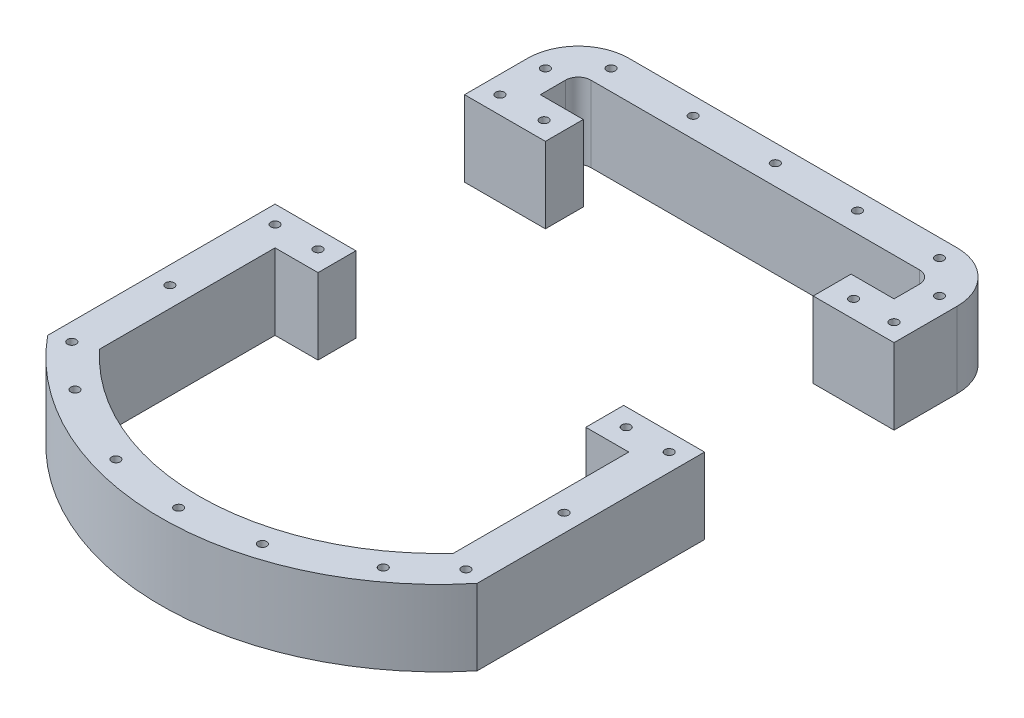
ISO-10303-21;
HEADER;
FILE_DESCRIPTION(('STEP AP214'),'2;1');
FILE_NAME('part.step','',(''),(''),'','','');
FILE_SCHEMA(('AUTOMOTIVE_DESIGN { 1 0 10303 214 1 1 1 1 }'));
ENDSEC;
DATA;
#1=APPLICATION_CONTEXT('core data for automotive mechanical design processes');
#2=APPLICATION_PROTOCOL_DEFINITION('international standard','automotive_design',2000,#1);
#3=PRODUCT_CONTEXT('',#1,'mechanical');
#4=PRODUCT('Part','Part','',(#3));
#5=PRODUCT_RELATED_PRODUCT_CATEGORY('part','',(#4));
#6=PRODUCT_DEFINITION_FORMATION('','',#4);
#7=PRODUCT_DEFINITION_CONTEXT('part definition',#1,'design');
#8=PRODUCT_DEFINITION('design','',#6,#7);
#9=PRODUCT_DEFINITION_SHAPE('','',#8);
#10=(LENGTH_UNIT() NAMED_UNIT(*) SI_UNIT(.MILLI.,.METRE.));
#11=(NAMED_UNIT(*) PLANE_ANGLE_UNIT() SI_UNIT($,.RADIAN.));
#12=(NAMED_UNIT(*) SI_UNIT($,.STERADIAN.) SOLID_ANGLE_UNIT());
#13=UNCERTAINTY_MEASURE_WITH_UNIT(LENGTH_MEASURE(1.E-05),#10,'distance_accuracy_value','');
#14=(GEOMETRIC_REPRESENTATION_CONTEXT(3) GLOBAL_UNCERTAINTY_ASSIGNED_CONTEXT((#13)) GLOBAL_UNIT_ASSIGNED_CONTEXT((#10,
#11,#12)) REPRESENTATION_CONTEXT('',''));
#15=CARTESIAN_POINT('',(0.,0.,0.));
#16=DIRECTION('',(0.,0.,1.));
#17=DIRECTION('',(1.,0.,0.));
#18=AXIS2_PLACEMENT_3D('',#15,#16,#17);
#19=CARTESIAN_POINT('',(70.,30.,-10.0000000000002));
#20=DIRECTION('',(-1.,0.,0.));
#21=DIRECTION('',(0.,0.,1.));
#22=AXIS2_PLACEMENT_3D('',#19,#20,#21);
#23=PLANE('',#22);
#24=DIRECTION('',(0.,0.,-1.));
#25=VECTOR('',#24,1.);
#26=CARTESIAN_POINT('',(70.,0.,-10.0000000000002));
#27=LINE('',#26,#25);
#28=CARTESIAN_POINT('',(70.,0.,59.4049626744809));
#29=VERTEX_POINT('',#28);
#30=CARTESIAN_POINT('',(70.,0.,-10.0000000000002));
#31=VERTEX_POINT('',#30);
#32=EDGE_CURVE('E175',#29,#31,#27,.T.);
#33=ORIENTED_EDGE('',*,*,#32,.F.);
#34=DIRECTION('',(0.,-1.,0.));
#35=VECTOR('',#34,1.);
#36=CARTESIAN_POINT('',(70.,30.,59.4049626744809));
#37=LINE('',#36,#35);
#38=CARTESIAN_POINT('',(70.,30.,59.4049626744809));
#39=VERTEX_POINT('',#38);
#40=EDGE_CURVE('E185',#39,#29,#37,.T.);
#41=ORIENTED_EDGE('',*,*,#40,.F.);
#42=DIRECTION('',(0.,0.,-1.));
#43=VECTOR('',#42,1.);
#44=CARTESIAN_POINT('',(70.,30.,-10.0000000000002));
#45=LINE('',#44,#43);
#46=CARTESIAN_POINT('',(70.,30.,-10.0000000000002));
#47=VERTEX_POINT('',#46);
#48=EDGE_CURVE('E161',#39,#47,#45,.T.);
#49=ORIENTED_EDGE('',*,*,#48,.T.);
#50=DIRECTION('',(0.,-1.,0.));
#51=VECTOR('',#50,1.);
#52=CARTESIAN_POINT('',(70.,30.,-10.0000000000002));
#53=LINE('',#52,#51);
#54=EDGE_CURVE('E159',#47,#31,#53,.T.);
#55=ORIENTED_EDGE('',*,*,#54,.T.);
#56=EDGE_LOOP('',(#33,#41,#49,#55));
#57=FACE_BOUND('',#56,.T.);
#58=ADVANCED_FACE('F44',(#57),#23,.T.);
#59=CARTESIAN_POINT('',(0.,30.,-4.8212002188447));
#60=DIRECTION('',(0.,-1.,0.));
#61=DIRECTION('',(0.,0.,-1.));
#62=AXIS2_PLACEMENT_3D('',#59,#60,#61);
#63=CYLINDRICAL_SURFACE('',#62,95.);
#64=CARTESIAN_POINT('',(0.,0.,-4.8212002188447));
#65=DIRECTION('',(0.,1.,0.));
#66=DIRECTION('',(0.,0.,-1.));
#67=AXIS2_PLACEMENT_3D('',#64,#65,#66);
#68=CIRCLE('',#67,95.);
#69=CARTESIAN_POINT('',(-70.,0.,59.4049626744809));
#70=VERTEX_POINT('',#69);
#71=EDGE_CURVE('E172',#70,#29,#68,.T.);
#72=ORIENTED_EDGE('',*,*,#71,.F.);
#73=DIRECTION('',(0.,-1.,0.));
#74=VECTOR('',#73,1.);
#75=CARTESIAN_POINT('',(-70.,30.,59.4049626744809));
#76=LINE('',#75,#74);
#77=CARTESIAN_POINT('',(-70.,30.,59.4049626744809));
#78=VERTEX_POINT('',#77);
#79=EDGE_CURVE('E187',#78,#70,#76,.T.);
#80=ORIENTED_EDGE('',*,*,#79,.F.);
#81=CARTESIAN_POINT('',(0.,30.,-4.8212002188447));
#82=DIRECTION('',(0.,1.,0.));
#83=DIRECTION('',(0.,0.,-1.));
#84=AXIS2_PLACEMENT_3D('',#81,#82,#83);
#85=CIRCLE('',#84,95.);
#86=EDGE_CURVE('E285',#78,#39,#85,.T.);
#87=ORIENTED_EDGE('',*,*,#86,.T.);
#88=ORIENTED_EDGE('',*,*,#40,.T.);
#89=EDGE_LOOP('',(#72,#80,#87,#88));
#90=FACE_BOUND('',#89,.T.);
#91=ADVANCED_FACE('F241',(#90),#63,.F.);
#92=CARTESIAN_POINT('',(-70.,30.,-10.0000000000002));
#93=DIRECTION('',(1.,0.,0.));
#94=DIRECTION('',(0.,0.,-1.));
#95=AXIS2_PLACEMENT_3D('',#92,#93,#94);
#96=PLANE('',#95);
#97=DIRECTION('',(0.,0.,1.));
#98=VECTOR('',#97,1.);
#99=CARTESIAN_POINT('',(-70.,0.,-10.0000000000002));
#100=LINE('',#99,#98);
#101=CARTESIAN_POINT('',(-70.,0.,-10.0000000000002));
#102=VERTEX_POINT('',#101);
#103=EDGE_CURVE('E169',#102,#70,#100,.T.);
#104=ORIENTED_EDGE('',*,*,#103,.F.);
#105=DIRECTION('',(0.,-1.,0.));
#106=VECTOR('',#105,1.);
#107=CARTESIAN_POINT('',(-70.,30.,-10.0000000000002));
#108=LINE('',#107,#106);
#109=CARTESIAN_POINT('',(-70.,30.,-10.0000000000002));
#110=VERTEX_POINT('',#109);
#111=EDGE_CURVE('E189',#110,#102,#108,.T.);
#112=ORIENTED_EDGE('',*,*,#111,.F.);
#113=DIRECTION('',(0.,0.,1.));
#114=VECTOR('',#113,1.);
#115=CARTESIAN_POINT('',(-70.,30.,-10.0000000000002));
#116=LINE('',#115,#114);
#117=EDGE_CURVE('E280',#110,#78,#116,.T.);
#118=ORIENTED_EDGE('',*,*,#117,.T.);
#119=ORIENTED_EDGE('',*,*,#79,.T.);
#120=EDGE_LOOP('',(#104,#112,#118,#119));
#121=FACE_BOUND('',#120,.T.);
#122=ADVANCED_FACE('F247',(#121),#96,.T.);
#123=CARTESIAN_POINT('',(0.,30.,-4.8212002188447));
#124=DIRECTION('',(0.,-1.,0.));
#125=DIRECTION('',(0.,0.,-1.));
#126=AXIS2_PLACEMENT_3D('',#123,#124,#125);
#127=CYLINDRICAL_SURFACE('',#126,110.);
#128=CARTESIAN_POINT('',(0.,0.,-4.8212002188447));
#129=DIRECTION('',(0.,1.,0.));
#130=DIRECTION('',(0.,0.,-1.));
#131=AXIS2_PLACEMENT_3D('',#128,#129,#130);
#132=CIRCLE('',#131,110.);
#133=CARTESIAN_POINT('',(-85.,0.,64.9999999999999));
#134=VERTEX_POINT('',#133);
#135=CARTESIAN_POINT('',(85.0000000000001,0.,64.9999999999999));
#136=VERTEX_POINT('',#135);
#137=EDGE_CURVE('E204',#134,#136,#132,.T.);
#138=ORIENTED_EDGE('',*,*,#137,.T.);
#139=DIRECTION('',(0.,-1.,0.));
#140=VECTOR('',#139,1.);
#141=CARTESIAN_POINT('',(85.0000000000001,30.,64.9999999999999));
#142=LINE('',#141,#140);
#143=CARTESIAN_POINT('',(85.0000000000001,30.,64.9999999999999));
#144=VERTEX_POINT('',#143);
#145=EDGE_CURVE('E210',#144,#136,#142,.T.);
#146=ORIENTED_EDGE('',*,*,#145,.F.);
#147=CARTESIAN_POINT('',(0.,30.,-4.8212002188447));
#148=DIRECTION('',(0.,1.,0.));
#149=DIRECTION('',(0.,0.,-1.));
#150=AXIS2_PLACEMENT_3D('',#147,#148,#149);
#151=CIRCLE('',#150,110.);
#152=CARTESIAN_POINT('',(-85.,30.,64.9999999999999));
#153=VERTEX_POINT('',#152);
#154=EDGE_CURVE('E198',#153,#144,#151,.T.);
#155=ORIENTED_EDGE('',*,*,#154,.F.);
#156=DIRECTION('',(0.,-1.,0.));
#157=VECTOR('',#156,1.);
#158=CARTESIAN_POINT('',(-85.,30.,64.9999999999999));
#159=LINE('',#158,#157);
#160=EDGE_CURVE('E52',#153,#134,#159,.T.);
#161=ORIENTED_EDGE('',*,*,#160,.T.);
#162=EDGE_LOOP('',(#138,#146,#155,#161));
#163=FACE_BOUND('',#162,.T.);
#164=ADVANCED_FACE('F217',(#163),#127,.T.);
#165=CARTESIAN_POINT('',(-85.,30.,-25.0000000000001));
#166=DIRECTION('',(1.,0.,0.));
#167=DIRECTION('',(0.,0.,-1.));
#168=AXIS2_PLACEMENT_3D('',#165,#166,#167);
#169=PLANE('',#168);
#170=DIRECTION('',(0.,0.,1.));
#171=VECTOR('',#170,1.);
#172=CARTESIAN_POINT('',(-85.,0.,-25.0000000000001));
#173=LINE('',#172,#171);
#174=CARTESIAN_POINT('',(-85.,0.,-25.0000000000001));
#175=VERTEX_POINT('',#174);
#176=EDGE_CURVE('E202',#175,#134,#173,.T.);
#177=ORIENTED_EDGE('',*,*,#176,.T.);
#178=ORIENTED_EDGE('',*,*,#160,.F.);
#179=DIRECTION('',(0.,0.,1.));
#180=VECTOR('',#179,1.);
#181=CARTESIAN_POINT('',(-85.,30.,-25.0000000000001));
#182=LINE('',#181,#180);
#183=CARTESIAN_POINT('',(-85.,30.,-25.0000000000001));
#184=VERTEX_POINT('',#183);
#185=EDGE_CURVE('E196',#184,#153,#182,.T.);
#186=ORIENTED_EDGE('',*,*,#185,.F.);
#187=DIRECTION('',(0.,-1.,0.));
#188=VECTOR('',#187,1.);
#189=CARTESIAN_POINT('',(-85.,30.,-25.0000000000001));
#190=LINE('',#189,#188);
#191=EDGE_CURVE('E12',#184,#175,#190,.T.);
#192=ORIENTED_EDGE('',*,*,#191,.T.);
#193=EDGE_LOOP('',(#177,#178,#186,#192));
#194=FACE_BOUND('',#193,.T.);
#195=ADVANCED_FACE('F229',(#194),#169,.F.);
#196=CARTESIAN_POINT('',(85.,30.,-25.0000000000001));
#197=DIRECTION('',(-1.,0.,0.));
#198=DIRECTION('',(0.,0.,1.));
#199=AXIS2_PLACEMENT_3D('',#196,#197,#198);
#200=PLANE('',#199);
#201=DIRECTION('',(0.,0.,-1.));
#202=VECTOR('',#201,1.);
#203=CARTESIAN_POINT('',(85.,0.,-25.0000000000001));
#204=LINE('',#203,#202);
#205=CARTESIAN_POINT('',(85.,0.,-25.0000000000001));
#206=VERTEX_POINT('',#205);
#207=EDGE_CURVE('E206',#136,#206,#204,.T.);
#208=ORIENTED_EDGE('',*,*,#207,.T.);
#209=DIRECTION('',(0.,-1.,0.));
#210=VECTOR('',#209,1.);
#211=CARTESIAN_POINT('',(85.,30.,-25.0000000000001));
#212=LINE('',#211,#210);
#213=CARTESIAN_POINT('',(85.,30.,-25.0000000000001));
#214=VERTEX_POINT('',#213);
#215=EDGE_CURVE('E144',#214,#206,#212,.T.);
#216=ORIENTED_EDGE('',*,*,#215,.F.);
#217=DIRECTION('',(0.,0.,-1.));
#218=VECTOR('',#217,1.);
#219=CARTESIAN_POINT('',(85.,30.,-25.0000000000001));
#220=LINE('',#219,#218);
#221=EDGE_CURVE('E142',#144,#214,#220,.T.);
#222=ORIENTED_EDGE('',*,*,#221,.F.);
#223=ORIENTED_EDGE('',*,*,#145,.T.);
#224=EDGE_LOOP('',(#208,#216,#222,#223));
#225=FACE_BOUND('',#224,.T.);
#226=ADVANCED_FACE('F226',(#225),#200,.F.);
#227=CARTESIAN_POINT('',(-53.,30.,-10.0000000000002));
#228=DIRECTION('',(0.,0.,1.));
#229=DIRECTION('',(1.,0.,0.));
#230=AXIS2_PLACEMENT_3D('',#227,#228,#229);
#231=PLANE('',#230);
#232=DIRECTION('',(-1.,0.,0.));
#233=VECTOR('',#232,1.);
#234=CARTESIAN_POINT('',(-53.,0.,-10.0000000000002));
#235=LINE('',#234,#233);
#236=CARTESIAN_POINT('',(-53.,0.,-10.0000000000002));
#237=VERTEX_POINT('',#236);
#238=EDGE_CURVE('E166',#237,#102,#235,.T.);
#239=ORIENTED_EDGE('',*,*,#238,.F.);
#240=DIRECTION('',(0.,-1.,0.));
#241=VECTOR('',#240,1.);
#242=CARTESIAN_POINT('',(-53.,30.,-10.0000000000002));
#243=LINE('',#242,#241);
#244=CARTESIAN_POINT('',(-53.,30.,-10.0000000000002));
#245=VERTEX_POINT('',#244);
#246=EDGE_CURVE('E191',#245,#237,#243,.T.);
#247=ORIENTED_EDGE('',*,*,#246,.F.);
#248=DIRECTION('',(-1.,0.,0.));
#249=VECTOR('',#248,1.);
#250=CARTESIAN_POINT('',(-53.,30.,-10.0000000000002));
#251=LINE('',#250,#249);
#252=EDGE_CURVE('E277',#245,#110,#251,.T.);
#253=ORIENTED_EDGE('',*,*,#252,.T.);
#254=ORIENTED_EDGE('',*,*,#111,.T.);
#255=EDGE_LOOP('',(#239,#247,#253,#254));
#256=FACE_BOUND('',#255,.T.);
#257=ADVANCED_FACE('F228',(#256),#231,.T.);
#258=CARTESIAN_POINT('',(53.,30.,-10.0000000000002));
#259=DIRECTION('',(0.,0.,1.));
#260=DIRECTION('',(1.,0.,0.));
#261=AXIS2_PLACEMENT_3D('',#258,#259,#260);
#262=PLANE('',#261);
#263=DIRECTION('',(-1.,0.,0.));
#264=VECTOR('',#263,1.);
#265=CARTESIAN_POINT('',(53.,0.,-10.0000000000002));
#266=LINE('',#265,#264);
#267=CARTESIAN_POINT('',(53.,0.,-10.0000000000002));
#268=VERTEX_POINT('',#267);
#269=EDGE_CURVE('E178',#31,#268,#266,.T.);
#270=ORIENTED_EDGE('',*,*,#269,.F.);
#271=ORIENTED_EDGE('',*,*,#54,.F.);
#272=DIRECTION('',(-1.,0.,0.));
#273=VECTOR('',#272,1.);
#274=CARTESIAN_POINT('',(53.,30.,-10.0000000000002));
#275=LINE('',#274,#273);
#276=CARTESIAN_POINT('',(53.,30.,-10.0000000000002));
#277=VERTEX_POINT('',#276);
#278=EDGE_CURVE('E157',#47,#277,#275,.T.);
#279=ORIENTED_EDGE('',*,*,#278,.T.);
#280=DIRECTION('',(0.,-1.,0.));
#281=VECTOR('',#280,1.);
#282=CARTESIAN_POINT('',(53.,30.,-10.0000000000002));
#283=LINE('',#282,#281);
#284=EDGE_CURVE('E156',#277,#268,#283,.T.);
#285=ORIENTED_EDGE('',*,*,#284,.T.);
#286=EDGE_LOOP('',(#270,#271,#279,#285));
#287=FACE_BOUND('',#286,.T.);
#288=ADVANCED_FACE('F235',(#287),#262,.T.);
#289=CARTESIAN_POINT('',(53.,30.,-115.));
#290=DIRECTION('',(-1.,0.,0.));
#291=DIRECTION('',(0.,0.,1.));
#292=AXIS2_PLACEMENT_3D('',#289,#290,#291);
#293=PLANE('',#292);
#294=DIRECTION('',(0.,1.,0.));
#295=VECTOR('',#294,1.);
#296=CARTESIAN_POINT('',(53.,-0.001000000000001,-25.0000000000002));
#297=LINE('',#296,#295);
#298=CARTESIAN_POINT('',(53.,0.,-25.0000000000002));
#299=VERTEX_POINT('',#298);
#300=CARTESIAN_POINT('',(53.,30.,-25.0000000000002));
#301=VERTEX_POINT('',#300);
#302=EDGE_CURVE('E146',#299,#301,#297,.T.);
#303=ORIENTED_EDGE('',*,*,#302,.F.);
#304=DIRECTION('',(0.,0.,-1.));
#305=VECTOR('',#304,1.);
#306=CARTESIAN_POINT('',(53.,0.,-115.));
#307=LINE('',#306,#305);
#308=EDGE_CURVE('E181',#268,#299,#307,.T.);
#309=ORIENTED_EDGE('',*,*,#308,.F.);
#310=ORIENTED_EDGE('',*,*,#284,.F.);
#311=DIRECTION('',(0.,0.,-1.));
#312=VECTOR('',#311,1.);
#313=CARTESIAN_POINT('',(53.,30.,-115.));
#314=LINE('',#313,#312);
#315=EDGE_CURVE('E140',#277,#301,#314,.T.);
#316=ORIENTED_EDGE('',*,*,#315,.T.);
#317=EDGE_LOOP('',(#303,#309,#310,#316));
#318=FACE_BOUND('',#317,.T.);
#319=ADVANCED_FACE('F155',(#318),#293,.T.);
#320=CARTESIAN_POINT('',(-53.,30.,-115.));
#321=DIRECTION('',(1.,0.,0.));
#322=DIRECTION('',(0.,0.,-1.));
#323=AXIS2_PLACEMENT_3D('',#320,#321,#322);
#324=PLANE('',#323);
#325=DIRECTION('',(0.,1.,0.));
#326=VECTOR('',#325,1.);
#327=CARTESIAN_POINT('',(-53.,-0.001000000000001,-25.0000000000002));
#328=LINE('',#327,#326);
#329=CARTESIAN_POINT('',(-53.,0.,-25.0000000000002));
#330=VERTEX_POINT('',#329);
#331=CARTESIAN_POINT('',(-53.,30.,-25.0000000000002));
#332=VERTEX_POINT('',#331);
#333=EDGE_CURVE('E152',#330,#332,#328,.T.);
#334=ORIENTED_EDGE('',*,*,#333,.T.);
#335=DIRECTION('',(0.,0.,1.));
#336=VECTOR('',#335,1.);
#337=CARTESIAN_POINT('',(-53.,30.,-115.));
#338=LINE('',#337,#336);
#339=EDGE_CURVE('E182',#332,#245,#338,.T.);
#340=ORIENTED_EDGE('',*,*,#339,.T.);
#341=ORIENTED_EDGE('',*,*,#246,.T.);
#342=DIRECTION('',(0.,0.,1.));
#343=VECTOR('',#342,1.);
#344=CARTESIAN_POINT('',(-53.,0.,-115.));
#345=LINE('',#344,#343);
#346=EDGE_CURVE('E151',#330,#237,#345,.T.);
#347=ORIENTED_EDGE('',*,*,#346,.F.);
#348=EDGE_LOOP('',(#334,#340,#341,#347));
#349=FACE_BOUND('',#348,.T.);
#350=ADVANCED_FACE('F257',(#349),#324,.T.);
#351=CARTESIAN_POINT('',(-68.,30.,-25.0000000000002));
#352=DIRECTION('',(0.,0.,1.));
#353=DIRECTION('',(1.,0.,0.));
#354=AXIS2_PLACEMENT_3D('',#351,#352,#353);
#355=PLANE('',#354);
#356=DIRECTION('',(-1.,0.,0.));
#357=VECTOR('',#356,1.);
#358=CARTESIAN_POINT('',(-68.,0.,-25.0000000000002));
#359=LINE('',#358,#357);
#360=EDGE_CURVE('E194',#330,#175,#359,.T.);
#361=ORIENTED_EDGE('',*,*,#360,.T.);
#362=ORIENTED_EDGE('',*,*,#191,.F.);
#363=DIRECTION('',(-1.,0.,0.));
#364=VECTOR('',#363,1.);
#365=CARTESIAN_POINT('',(-68.,30.,-25.0000000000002));
#366=LINE('',#365,#364);
#367=EDGE_CURVE('E59',#332,#184,#366,.T.);
#368=ORIENTED_EDGE('',*,*,#367,.F.);
#369=ORIENTED_EDGE('',*,*,#333,.F.);
#370=EDGE_LOOP('',(#361,#362,#368,#369));
#371=FACE_BOUND('',#370,.T.);
#372=ADVANCED_FACE('F46',(#371),#355,.F.);
#373=CARTESIAN_POINT('',(68.,30.,-25.0000000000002));
#374=DIRECTION('',(0.,0.,1.));
#375=DIRECTION('',(1.,0.,0.));
#376=AXIS2_PLACEMENT_3D('',#373,#374,#375);
#377=PLANE('',#376);
#378=DIRECTION('',(-1.,0.,0.));
#379=VECTOR('',#378,1.);
#380=CARTESIAN_POINT('',(68.,0.,-25.0000000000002));
#381=LINE('',#380,#379);
#382=EDGE_CURVE('E67',#206,#299,#381,.T.);
#383=ORIENTED_EDGE('',*,*,#382,.T.);
#384=ORIENTED_EDGE('',*,*,#302,.T.);
#385=DIRECTION('',(-1.,0.,0.));
#386=VECTOR('',#385,1.);
#387=CARTESIAN_POINT('',(68.,30.,-25.0000000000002));
#388=LINE('',#387,#386);
#389=EDGE_CURVE('E136',#214,#301,#388,.T.);
#390=ORIENTED_EDGE('',*,*,#389,.F.);
#391=ORIENTED_EDGE('',*,*,#215,.T.);
#392=EDGE_LOOP('',(#383,#384,#390,#391));
#393=FACE_BOUND('',#392,.T.);
#394=ADVANCED_FACE('F147',(#393),#377,.F.);
#395=CARTESIAN_POINT('',(65.,0.,-125.));
#396=DIRECTION('',(0.,-1.,0.));
#397=DIRECTION('',(0.,0.,-1.));
#398=AXIS2_PLACEMENT_3D('',#395,#396,#397);
#399=PLANE('',#398);
#400=CARTESIAN_POINT('',(-61.,0.,-18.0000000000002));
#401=DIRECTION('',(0.,-1.,0.));
#402=DIRECTION('',(0.,0.,-1.));
#403=AXIS2_PLACEMENT_3D('',#400,#401,#402);
#404=CIRCLE('',#403,1.7);
#405=CARTESIAN_POINT('',(-61.,0.,-19.7000000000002));
#406=VERTEX_POINT('',#405);
#407=EDGE_CURVE('E297',#406,#406,#404,.T.);
#408=ORIENTED_EDGE('',*,*,#407,.F.);
#409=EDGE_LOOP('',(#408));
#410=FACE_BOUND('',#409,.T.);
#411=CARTESIAN_POINT('',(-78.,0.,-18.0000000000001));
#412=DIRECTION('',(0.,-1.,0.));
#413=DIRECTION('',(0.,0.,-1.));
#414=AXIS2_PLACEMENT_3D('',#411,#412,#413);
#415=CIRCLE('',#414,1.7);
#416=CARTESIAN_POINT('',(-78.,0.,-19.7000000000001));
#417=VERTEX_POINT('',#416);
#418=EDGE_CURVE('E299',#417,#417,#415,.T.);
#419=ORIENTED_EDGE('',*,*,#418,.F.);
#420=EDGE_LOOP('',(#419));
#421=FACE_BOUND('',#420,.T.);
#422=CARTESIAN_POINT('',(-78.,0.,23.6199999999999));
#423=DIRECTION('',(0.,-1.,0.));
#424=DIRECTION('',(0.,0.,-1.));
#425=AXIS2_PLACEMENT_3D('',#422,#423,#424);
#426=CIRCLE('',#425,1.70000000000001);
#427=CARTESIAN_POINT('',(-78.,0.,21.9199999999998));
#428=VERTEX_POINT('',#427);
#429=EDGE_CURVE('E304',#428,#428,#426,.T.);
#430=ORIENTED_EDGE('',*,*,#429,.F.);
#431=EDGE_LOOP('',(#430));
#432=FACE_BOUND('',#431,.T.);
#433=CARTESIAN_POINT('',(-78.,0.,62.4469200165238));
#434=DIRECTION('',(0.,-1.,0.));
#435=DIRECTION('',(0.,0.,-1.));
#436=AXIS2_PLACEMENT_3D('',#433,#434,#435);
#437=CIRCLE('',#436,1.70000000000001);
#438=CARTESIAN_POINT('',(-78.,0.,60.7469200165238));
#439=VERTEX_POINT('',#438);
#440=EDGE_CURVE('E309',#439,#439,#437,.T.);
#441=ORIENTED_EDGE('',*,*,#440,.F.);
#442=EDGE_LOOP('',(#441));
#443=FACE_BOUND('',#442,.T.);
#444=CARTESIAN_POINT('',(-61.,0.,78.172775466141));
#445=DIRECTION('',(0.,-1.,0.));
#446=DIRECTION('',(0.,0.,-1.));
#447=AXIS2_PLACEMENT_3D('',#444,#445,#446);
#448=CIRCLE('',#447,1.7);
#449=CARTESIAN_POINT('',(-61.,0.,76.472775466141));
#450=VERTEX_POINT('',#449);
#451=EDGE_CURVE('E312',#450,#450,#448,.T.);
#452=ORIENTED_EDGE('',*,*,#451,.F.);
#453=EDGE_LOOP('',(#452));
#454=FACE_BOUND('',#453,.T.);
#455=CARTESIAN_POINT('',(0.,0.,98.1787997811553));
#456=DIRECTION('',(0.,-1.,0.));
#457=DIRECTION('',(0.,0.,-1.));
#458=AXIS2_PLACEMENT_3D('',#455,#456,#457);
#459=CIRCLE('',#458,1.7);
#460=CARTESIAN_POINT('',(0.,0.,96.4787997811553));
#461=VERTEX_POINT('',#460);
#462=EDGE_CURVE('E315',#461,#461,#459,.T.);
#463=ORIENTED_EDGE('',*,*,#462,.F.);
#464=EDGE_LOOP('',(#463));
#465=FACE_BOUND('',#464,.T.);
#466=CARTESIAN_POINT('',(61.,0.,-18.0000000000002));
#467=DIRECTION('',(0.,-1.,0.));
#468=DIRECTION('',(0.,0.,-1.));
#469=AXIS2_PLACEMENT_3D('',#466,#467,#468);
#470=CIRCLE('',#469,1.7);
#471=CARTESIAN_POINT('',(61.,0.,-19.7000000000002));
#472=VERTEX_POINT('',#471);
#473=EDGE_CURVE('E318',#472,#472,#470,.T.);
#474=ORIENTED_EDGE('',*,*,#473,.F.);
#475=EDGE_LOOP('',(#474));
#476=FACE_BOUND('',#475,.T.);
#477=CARTESIAN_POINT('',(-29.,0.,94.011992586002));
#478=DIRECTION('',(0.,-1.,0.));
#479=DIRECTION('',(0.,0.,-1.));
#480=AXIS2_PLACEMENT_3D('',#477,#478,#479);
#481=CIRCLE('',#480,1.7);
#482=CARTESIAN_POINT('',(-29.,0.,92.311992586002));
#483=VERTEX_POINT('',#482);
#484=EDGE_CURVE('E321',#483,#483,#481,.T.);
#485=ORIENTED_EDGE('',*,*,#484,.F.);
#486=EDGE_LOOP('',(#485));
#487=FACE_BOUND('',#486,.T.);
#488=CARTESIAN_POINT('',(78.,0.,-18.0000000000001));
#489=DIRECTION('',(0.,-1.,0.));
#490=DIRECTION('',(0.,0.,-1.));
#491=AXIS2_PLACEMENT_3D('',#488,#489,#490);
#492=CIRCLE('',#491,1.69999999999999);
#493=CARTESIAN_POINT('',(78.,0.,-19.7000000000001));
#494=VERTEX_POINT('',#493);
#495=EDGE_CURVE('E324',#494,#494,#492,.T.);
#496=ORIENTED_EDGE('',*,*,#495,.F.);
#497=EDGE_LOOP('',(#496));
#498=FACE_BOUND('',#497,.T.);
#499=CARTESIAN_POINT('',(78.,0.,23.6199999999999));
#500=DIRECTION('',(0.,-1.,0.));
#501=DIRECTION('',(0.,0.,-1.));
#502=AXIS2_PLACEMENT_3D('',#499,#500,#501);
#503=CIRCLE('',#502,1.70000000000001);
#504=CARTESIAN_POINT('',(78.,0.,21.9199999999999));
#505=VERTEX_POINT('',#504);
#506=EDGE_CURVE('E327',#505,#505,#503,.T.);
#507=ORIENTED_EDGE('',*,*,#506,.F.);
#508=EDGE_LOOP('',(#507));
#509=FACE_BOUND('',#508,.T.);
#510=CARTESIAN_POINT('',(78.0000000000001,0.,62.4469200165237));
#511=DIRECTION('',(0.,-1.,0.));
#512=DIRECTION('',(0.,0.,-1.));
#513=AXIS2_PLACEMENT_3D('',#510,#511,#512);
#514=CIRCLE('',#513,1.70000000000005);
#515=CARTESIAN_POINT('',(78.0000000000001,0.,60.7469200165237));
#516=VERTEX_POINT('',#515);
#517=EDGE_CURVE('E330',#516,#516,#514,.T.);
#518=ORIENTED_EDGE('',*,*,#517,.F.);
#519=EDGE_LOOP('',(#518));
#520=FACE_BOUND('',#519,.T.);
#521=CARTESIAN_POINT('',(61.,0.,78.172775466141));
#522=DIRECTION('',(0.,-1.,0.));
#523=DIRECTION('',(0.,0.,-1.));
#524=AXIS2_PLACEMENT_3D('',#521,#522,#523);
#525=CIRCLE('',#524,1.7);
#526=CARTESIAN_POINT('',(61.,0.,76.472775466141));
#527=VERTEX_POINT('',#526);
#528=EDGE_CURVE('E333',#527,#527,#525,.T.);
#529=ORIENTED_EDGE('',*,*,#528,.F.);
#530=EDGE_LOOP('',(#529));
#531=FACE_BOUND('',#530,.T.);
#532=CARTESIAN_POINT('',(29.,0.,94.011992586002));
#533=DIRECTION('',(0.,-1.,0.));
#534=DIRECTION('',(0.,0.,-1.));
#535=AXIS2_PLACEMENT_3D('',#532,#533,#534);
#536=CIRCLE('',#535,1.7);
#537=CARTESIAN_POINT('',(29.,0.,92.311992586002));
#538=VERTEX_POINT('',#537);
#539=EDGE_CURVE('E336',#538,#538,#536,.T.);
#540=ORIENTED_EDGE('',*,*,#539,.F.);
#541=EDGE_LOOP('',(#540));
#542=FACE_BOUND('',#541,.T.);
#543=ORIENTED_EDGE('',*,*,#308,.T.);
#544=ORIENTED_EDGE('',*,*,#382,.F.);
#545=ORIENTED_EDGE('',*,*,#207,.F.);
#546=ORIENTED_EDGE('',*,*,#137,.F.);
#547=ORIENTED_EDGE('',*,*,#176,.F.);
#548=ORIENTED_EDGE('',*,*,#360,.F.);
#549=ORIENTED_EDGE('',*,*,#346,.T.);
#550=ORIENTED_EDGE('',*,*,#238,.T.);
#551=ORIENTED_EDGE('',*,*,#103,.T.);
#552=ORIENTED_EDGE('',*,*,#71,.T.);
#553=ORIENTED_EDGE('',*,*,#32,.T.);
#554=ORIENTED_EDGE('',*,*,#269,.T.);
#555=EDGE_LOOP('',(#543,#544,#545,#546,#547,#548,#549,#550,#551,#552,#553,#554));
#556=FACE_BOUND('',#555,.T.);
#557=ADVANCED_FACE('F224',(#410,#421,#432,#443,#454,#465,#476,#487,#498,#509,#520,#531,#542,
#556),#399,.T.);
#558=CARTESIAN_POINT('',(65.,30.,-125.));
#559=DIRECTION('',(0.,-1.,0.));
#560=DIRECTION('',(0.,0.,-1.));
#561=AXIS2_PLACEMENT_3D('',#558,#559,#560);
#562=PLANE('',#561);
#563=CARTESIAN_POINT('',(-61.,30.,-18.0000000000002));
#564=DIRECTION('',(0.,1.,0.));
#565=DIRECTION('',(0.,0.,1.));
#566=AXIS2_PLACEMENT_3D('',#563,#564,#565);
#567=CIRCLE('',#566,1.7);
#568=CARTESIAN_POINT('',(-61.,30.,-16.3000000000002));
#569=VERTEX_POINT('',#568);
#570=EDGE_CURVE('E339',#569,#569,#567,.T.);
#571=ORIENTED_EDGE('',*,*,#570,.F.);
#572=EDGE_LOOP('',(#571));
#573=FACE_BOUND('',#572,.T.);
#574=CARTESIAN_POINT('',(-78.,30.,-18.0000000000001));
#575=DIRECTION('',(0.,1.,0.));
#576=DIRECTION('',(0.,0.,1.));
#577=AXIS2_PLACEMENT_3D('',#574,#575,#576);
#578=CIRCLE('',#577,1.7);
#579=CARTESIAN_POINT('',(-78.,30.,-16.3000000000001));
#580=VERTEX_POINT('',#579);
#581=EDGE_CURVE('E373',#580,#580,#578,.T.);
#582=ORIENTED_EDGE('',*,*,#581,.F.);
#583=EDGE_LOOP('',(#582));
#584=FACE_BOUND('',#583,.T.);
#585=CARTESIAN_POINT('',(-78.,30.,23.6199999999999));
#586=DIRECTION('',(0.,1.,0.));
#587=DIRECTION('',(0.,0.,1.));
#588=AXIS2_PLACEMENT_3D('',#585,#586,#587);
#589=CIRCLE('',#588,1.70000000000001);
#590=CARTESIAN_POINT('',(-78.,30.,25.3199999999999));
#591=VERTEX_POINT('',#590);
#592=EDGE_CURVE('E370',#591,#591,#589,.T.);
#593=ORIENTED_EDGE('',*,*,#592,.F.);
#594=EDGE_LOOP('',(#593));
#595=FACE_BOUND('',#594,.T.);
#596=CARTESIAN_POINT('',(-78.,30.,62.4469200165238));
#597=DIRECTION('',(0.,1.,0.));
#598=DIRECTION('',(0.,0.,1.));
#599=AXIS2_PLACEMENT_3D('',#596,#597,#598);
#600=CIRCLE('',#599,1.70000000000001);
#601=CARTESIAN_POINT('',(-78.,30.,64.1469200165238));
#602=VERTEX_POINT('',#601);
#603=EDGE_CURVE('E367',#602,#602,#600,.T.);
#604=ORIENTED_EDGE('',*,*,#603,.F.);
#605=EDGE_LOOP('',(#604));
#606=FACE_BOUND('',#605,.T.);
#607=CARTESIAN_POINT('',(-61.,30.,78.172775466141));
#608=DIRECTION('',(0.,1.,0.));
#609=DIRECTION('',(0.,0.,1.));
#610=AXIS2_PLACEMENT_3D('',#607,#608,#609);
#611=CIRCLE('',#610,1.7);
#612=CARTESIAN_POINT('',(-61.,30.,79.872775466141));
#613=VERTEX_POINT('',#612);
#614=EDGE_CURVE('E364',#613,#613,#611,.T.);
#615=ORIENTED_EDGE('',*,*,#614,.F.);
#616=EDGE_LOOP('',(#615));
#617=FACE_BOUND('',#616,.T.);
#618=CARTESIAN_POINT('',(0.,30.,98.1787997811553));
#619=DIRECTION('',(0.,1.,0.));
#620=DIRECTION('',(0.,0.,1.));
#621=AXIS2_PLACEMENT_3D('',#618,#619,#620);
#622=CIRCLE('',#621,1.7);
#623=CARTESIAN_POINT('',(0.,30.,99.8787997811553));
#624=VERTEX_POINT('',#623);
#625=EDGE_CURVE('E361',#624,#624,#622,.T.);
#626=ORIENTED_EDGE('',*,*,#625,.F.);
#627=EDGE_LOOP('',(#626));
#628=FACE_BOUND('',#627,.T.);
#629=CARTESIAN_POINT('',(61.,30.,-18.0000000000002));
#630=DIRECTION('',(0.,1.,0.));
#631=DIRECTION('',(0.,0.,-1.));
#632=AXIS2_PLACEMENT_3D('',#629,#630,#631);
#633=CIRCLE('',#632,1.7);
#634=CARTESIAN_POINT('',(61.,30.,-19.7000000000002));
#635=VERTEX_POINT('',#634);
#636=EDGE_CURVE('E358',#635,#635,#633,.T.);
#637=ORIENTED_EDGE('',*,*,#636,.F.);
#638=EDGE_LOOP('',(#637));
#639=FACE_BOUND('',#638,.T.);
#640=CARTESIAN_POINT('',(-29.,30.,94.011992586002));
#641=DIRECTION('',(0.,1.,0.));
#642=DIRECTION('',(0.,0.,1.));
#643=AXIS2_PLACEMENT_3D('',#640,#641,#642);
#644=CIRCLE('',#643,1.7);
#645=CARTESIAN_POINT('',(-29.,30.,95.711992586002));
#646=VERTEX_POINT('',#645);
#647=EDGE_CURVE('E355',#646,#646,#644,.T.);
#648=ORIENTED_EDGE('',*,*,#647,.F.);
#649=EDGE_LOOP('',(#648));
#650=FACE_BOUND('',#649,.T.);
#651=CARTESIAN_POINT('',(78.,30.,-18.0000000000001));
#652=DIRECTION('',(0.,1.,0.));
#653=DIRECTION('',(0.,0.,-1.));
#654=AXIS2_PLACEMENT_3D('',#651,#652,#653);
#655=CIRCLE('',#654,1.69999999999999);
#656=CARTESIAN_POINT('',(78.,30.,-19.7000000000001));
#657=VERTEX_POINT('',#656);
#658=EDGE_CURVE('E352',#657,#657,#655,.T.);
#659=ORIENTED_EDGE('',*,*,#658,.F.);
#660=EDGE_LOOP('',(#659));
#661=FACE_BOUND('',#660,.T.);
#662=CARTESIAN_POINT('',(78.,30.,23.6199999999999));
#663=DIRECTION('',(0.,1.,0.));
#664=DIRECTION('',(0.,0.,-1.));
#665=AXIS2_PLACEMENT_3D('',#662,#663,#664);
#666=CIRCLE('',#665,1.70000000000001);
#667=CARTESIAN_POINT('',(78.,30.,21.9199999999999));
#668=VERTEX_POINT('',#667);
#669=EDGE_CURVE('E349',#668,#668,#666,.T.);
#670=ORIENTED_EDGE('',*,*,#669,.F.);
#671=EDGE_LOOP('',(#670));
#672=FACE_BOUND('',#671,.T.);
#673=CARTESIAN_POINT('',(78.0000000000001,30.,62.4469200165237));
#674=DIRECTION('',(0.,1.,0.));
#675=DIRECTION('',(0.,0.,-1.));
#676=AXIS2_PLACEMENT_3D('',#673,#674,#675);
#677=CIRCLE('',#676,1.70000000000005);
#678=CARTESIAN_POINT('',(78.0000000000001,30.,60.7469200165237));
#679=VERTEX_POINT('',#678);
#680=EDGE_CURVE('E346',#679,#679,#677,.T.);
#681=ORIENTED_EDGE('',*,*,#680,.F.);
#682=EDGE_LOOP('',(#681));
#683=FACE_BOUND('',#682,.T.);
#684=CARTESIAN_POINT('',(61.,30.,78.172775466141));
#685=DIRECTION('',(0.,1.,0.));
#686=DIRECTION('',(0.,0.,-1.));
#687=AXIS2_PLACEMENT_3D('',#684,#685,#686);
#688=CIRCLE('',#687,1.7);
#689=CARTESIAN_POINT('',(61.,30.,76.472775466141));
#690=VERTEX_POINT('',#689);
#691=EDGE_CURVE('E343',#690,#690,#688,.T.);
#692=ORIENTED_EDGE('',*,*,#691,.F.);
#693=EDGE_LOOP('',(#692));
#694=FACE_BOUND('',#693,.T.);
#695=CARTESIAN_POINT('',(29.,30.,94.011992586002));
#696=DIRECTION('',(0.,1.,0.));
#697=DIRECTION('',(0.,0.,-1.));
#698=AXIS2_PLACEMENT_3D('',#695,#696,#697);
#699=CIRCLE('',#698,1.7);
#700=CARTESIAN_POINT('',(29.,30.,92.311992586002));
#701=VERTEX_POINT('',#700);
#702=EDGE_CURVE('E340',#701,#701,#699,.T.);
#703=ORIENTED_EDGE('',*,*,#702,.F.);
#704=EDGE_LOOP('',(#703));
#705=FACE_BOUND('',#704,.T.);
#706=ORIENTED_EDGE('',*,*,#389,.T.);
#707=ORIENTED_EDGE('',*,*,#315,.F.);
#708=ORIENTED_EDGE('',*,*,#278,.F.);
#709=ORIENTED_EDGE('',*,*,#48,.F.);
#710=ORIENTED_EDGE('',*,*,#86,.F.);
#711=ORIENTED_EDGE('',*,*,#117,.F.);
#712=ORIENTED_EDGE('',*,*,#252,.F.);
#713=ORIENTED_EDGE('',*,*,#339,.F.);
#714=ORIENTED_EDGE('',*,*,#367,.T.);
#715=ORIENTED_EDGE('',*,*,#185,.T.);
#716=ORIENTED_EDGE('',*,*,#154,.T.);
#717=ORIENTED_EDGE('',*,*,#221,.T.);
#718=EDGE_LOOP('',(#706,#707,#708,#709,#710,#711,#712,#713,#714,#715,#716,#717));
#719=FACE_BOUND('',#718,.T.);
#720=ADVANCED_FACE('F137',(#573,#584,#595,#606,#617,#628,#639,#650,#661,#672,#683,#694,#705,
#719),#562,.F.);
#721=CARTESIAN_POINT('',(29.,-2.,94.011992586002));
#722=DIRECTION('',(0.,1.,0.));
#723=DIRECTION('',(0.,0.,1.));
#724=AXIS2_PLACEMENT_3D('',#721,#722,#723);
#725=CYLINDRICAL_SURFACE('',#724,1.7);
#726=ORIENTED_EDGE('',*,*,#539,.T.);
#727=EDGE_LOOP('',(#726));
#728=FACE_BOUND('',#727,.T.);
#729=ORIENTED_EDGE('',*,*,#702,.T.);
#730=EDGE_LOOP('',(#729));
#731=FACE_BOUND('',#730,.T.);
#732=ADVANCED_FACE('F263',(#728,#731),#725,.F.);
#733=CARTESIAN_POINT('',(61.,-2.,78.172775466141));
#734=DIRECTION('',(0.,1.,0.));
#735=DIRECTION('',(0.,0.,1.));
#736=AXIS2_PLACEMENT_3D('',#733,#734,#735);
#737=CYLINDRICAL_SURFACE('',#736,1.7);
#738=ORIENTED_EDGE('',*,*,#528,.T.);
#739=EDGE_LOOP('',(#738));
#740=FACE_BOUND('',#739,.T.);
#741=ORIENTED_EDGE('',*,*,#691,.T.);
#742=EDGE_LOOP('',(#741));
#743=FACE_BOUND('',#742,.T.);
#744=ADVANCED_FACE('F406',(#740,#743),#737,.F.);
#745=CARTESIAN_POINT('',(78.0000000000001,-2.,62.4469200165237));
#746=DIRECTION('',(0.,1.,0.));
#747=DIRECTION('',(0.,0.,1.));
#748=AXIS2_PLACEMENT_3D('',#745,#746,#747);
#749=CYLINDRICAL_SURFACE('',#748,1.70000000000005);
#750=ORIENTED_EDGE('',*,*,#517,.T.);
#751=EDGE_LOOP('',(#750));
#752=FACE_BOUND('',#751,.T.);
#753=ORIENTED_EDGE('',*,*,#680,.T.);
#754=EDGE_LOOP('',(#753));
#755=FACE_BOUND('',#754,.T.);
#756=ADVANCED_FACE('F412',(#752,#755),#749,.F.);
#757=CARTESIAN_POINT('',(78.,-2.,23.6199999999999));
#758=DIRECTION('',(0.,1.,0.));
#759=DIRECTION('',(0.,0.,1.));
#760=AXIS2_PLACEMENT_3D('',#757,#758,#759);
#761=CYLINDRICAL_SURFACE('',#760,1.70000000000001);
#762=ORIENTED_EDGE('',*,*,#506,.T.);
#763=EDGE_LOOP('',(#762));
#764=FACE_BOUND('',#763,.T.);
#765=ORIENTED_EDGE('',*,*,#669,.T.);
#766=EDGE_LOOP('',(#765));
#767=FACE_BOUND('',#766,.T.);
#768=ADVANCED_FACE('F520',(#764,#767),#761,.F.);
#769=CARTESIAN_POINT('',(78.,-2.,-18.0000000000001));
#770=DIRECTION('',(0.,1.,0.));
#771=DIRECTION('',(0.,0.,1.));
#772=AXIS2_PLACEMENT_3D('',#769,#770,#771);
#773=CYLINDRICAL_SURFACE('',#772,1.69999999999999);
#774=ORIENTED_EDGE('',*,*,#495,.T.);
#775=EDGE_LOOP('',(#774));
#776=FACE_BOUND('',#775,.T.);
#777=ORIENTED_EDGE('',*,*,#658,.T.);
#778=EDGE_LOOP('',(#777));
#779=FACE_BOUND('',#778,.T.);
#780=ADVANCED_FACE('F528',(#776,#779),#773,.F.);
#781=CARTESIAN_POINT('',(-29.,-2.,94.011992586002));
#782=DIRECTION('',(0.,1.,0.));
#783=DIRECTION('',(0.,0.,1.));
#784=AXIS2_PLACEMENT_3D('',#781,#782,#783);
#785=CYLINDRICAL_SURFACE('',#784,1.7);
#786=ORIENTED_EDGE('',*,*,#484,.T.);
#787=EDGE_LOOP('',(#786));
#788=FACE_BOUND('',#787,.T.);
#789=ORIENTED_EDGE('',*,*,#647,.T.);
#790=EDGE_LOOP('',(#789));
#791=FACE_BOUND('',#790,.T.);
#792=ADVANCED_FACE('F537',(#788,#791),#785,.F.);
#793=CARTESIAN_POINT('',(61.,-2.,-18.0000000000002));
#794=DIRECTION('',(0.,1.,0.));
#795=DIRECTION('',(0.,0.,1.));
#796=AXIS2_PLACEMENT_3D('',#793,#794,#795);
#797=CYLINDRICAL_SURFACE('',#796,1.7);
#798=ORIENTED_EDGE('',*,*,#473,.T.);
#799=EDGE_LOOP('',(#798));
#800=FACE_BOUND('',#799,.T.);
#801=ORIENTED_EDGE('',*,*,#636,.T.);
#802=EDGE_LOOP('',(#801));
#803=FACE_BOUND('',#802,.T.);
#804=ADVANCED_FACE('F546',(#800,#803),#797,.F.);
#805=CARTESIAN_POINT('',(0.,-2.,98.1787997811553));
#806=DIRECTION('',(0.,1.,0.));
#807=DIRECTION('',(0.,0.,1.));
#808=AXIS2_PLACEMENT_3D('',#805,#806,#807);
#809=CYLINDRICAL_SURFACE('',#808,1.7);
#810=ORIENTED_EDGE('',*,*,#462,.T.);
#811=EDGE_LOOP('',(#810));
#812=FACE_BOUND('',#811,.T.);
#813=ORIENTED_EDGE('',*,*,#625,.T.);
#814=EDGE_LOOP('',(#813));
#815=FACE_BOUND('',#814,.T.);
#816=ADVANCED_FACE('F555',(#812,#815),#809,.F.);
#817=CARTESIAN_POINT('',(-61.,-2.,78.172775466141));
#818=DIRECTION('',(0.,1.,0.));
#819=DIRECTION('',(0.,0.,1.));
#820=AXIS2_PLACEMENT_3D('',#817,#818,#819);
#821=CYLINDRICAL_SURFACE('',#820,1.7);
#822=ORIENTED_EDGE('',*,*,#451,.T.);
#823=EDGE_LOOP('',(#822));
#824=FACE_BOUND('',#823,.T.);
#825=ORIENTED_EDGE('',*,*,#614,.T.);
#826=EDGE_LOOP('',(#825));
#827=FACE_BOUND('',#826,.T.);
#828=ADVANCED_FACE('F564',(#824,#827),#821,.F.);
#829=CARTESIAN_POINT('',(-78.,-2.,62.4469200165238));
#830=DIRECTION('',(0.,1.,0.));
#831=DIRECTION('',(0.,0.,1.));
#832=AXIS2_PLACEMENT_3D('',#829,#830,#831);
#833=CYLINDRICAL_SURFACE('',#832,1.70000000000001);
#834=ORIENTED_EDGE('',*,*,#440,.T.);
#835=EDGE_LOOP('',(#834));
#836=FACE_BOUND('',#835,.T.);
#837=ORIENTED_EDGE('',*,*,#603,.T.);
#838=EDGE_LOOP('',(#837));
#839=FACE_BOUND('',#838,.T.);
#840=ADVANCED_FACE('F573',(#836,#839),#833,.F.);
#841=CARTESIAN_POINT('',(-78.,-2.,23.6199999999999));
#842=DIRECTION('',(0.,1.,0.));
#843=DIRECTION('',(0.,0.,1.));
#844=AXIS2_PLACEMENT_3D('',#841,#842,#843);
#845=CYLINDRICAL_SURFACE('',#844,1.70000000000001);
#846=ORIENTED_EDGE('',*,*,#429,.T.);
#847=EDGE_LOOP('',(#846));
#848=FACE_BOUND('',#847,.T.);
#849=ORIENTED_EDGE('',*,*,#592,.T.);
#850=EDGE_LOOP('',(#849));
#851=FACE_BOUND('',#850,.T.);
#852=ADVANCED_FACE('F582',(#848,#851),#845,.F.);
#853=CARTESIAN_POINT('',(-78.,-2.,-18.0000000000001));
#854=DIRECTION('',(0.,1.,0.));
#855=DIRECTION('',(0.,0.,1.));
#856=AXIS2_PLACEMENT_3D('',#853,#854,#855);
#857=CYLINDRICAL_SURFACE('',#856,1.7);
#858=ORIENTED_EDGE('',*,*,#418,.T.);
#859=EDGE_LOOP('',(#858));
#860=FACE_BOUND('',#859,.T.);
#861=ORIENTED_EDGE('',*,*,#581,.T.);
#862=EDGE_LOOP('',(#861));
#863=FACE_BOUND('',#862,.T.);
#864=ADVANCED_FACE('F591',(#860,#863),#857,.F.);
#865=CARTESIAN_POINT('',(-61.,-2.,-18.0000000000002));
#866=DIRECTION('',(0.,1.,0.));
#867=DIRECTION('',(0.,0.,1.));
#868=AXIS2_PLACEMENT_3D('',#865,#866,#867);
#869=CYLINDRICAL_SURFACE('',#868,1.7);
#870=ORIENTED_EDGE('',*,*,#407,.T.);
#871=EDGE_LOOP('',(#870));
#872=FACE_BOUND('',#871,.T.);
#873=ORIENTED_EDGE('',*,*,#570,.T.);
#874=EDGE_LOOP('',(#873));
#875=FACE_BOUND('',#874,.T.);
#876=ADVANCED_FACE('F379',(#872,#875),#869,.F.);
#877=CLOSED_SHELL('',(#58,#91,#122,#164,#195,#226,#257,#288,#319,#350,#372,#394,#557,#720,#732,
#744,#756,#768,#780,#792,#804,#816,#828,#840,#852,#864,#876));
#878=MANIFOLD_SOLID_BREP('B2',#877);
#879=CARTESIAN_POINT('',(-53.,30.,-115.));
#880=DIRECTION('',(1.,0.,0.));
#881=DIRECTION('',(0.,0.,-1.));
#882=AXIS2_PLACEMENT_3D('',#879,#880,#881);
#883=PLANE('',#882);
#884=DIRECTION('',(0.,1.,0.));
#885=VECTOR('',#884,1.);
#886=CARTESIAN_POINT('',(-53.,-0.001000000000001,-100.));
#887=LINE('',#886,#885);
#888=CARTESIAN_POINT('',(-53.,0.,-100.));
#889=VERTEX_POINT('',#888);
#890=CARTESIAN_POINT('',(-53.,30.,-100.));
#891=VERTEX_POINT('',#890);
#892=EDGE_CURVE('E42',#889,#891,#887,.T.);
#893=ORIENTED_EDGE('',*,*,#892,.F.);
#894=DIRECTION('',(0.,0.,1.));
#895=VECTOR('',#894,1.);
#896=CARTESIAN_POINT('',(-53.,0.,-115.));
#897=LINE('',#896,#895);
#898=CARTESIAN_POINT('',(-53.,0.,-115.));
#899=VERTEX_POINT('',#898);
#900=EDGE_CURVE('E801',#899,#889,#897,.T.);
#901=ORIENTED_EDGE('',*,*,#900,.F.);
#902=DIRECTION('',(0.,-1.,0.));
#903=VECTOR('',#902,1.);
#904=CARTESIAN_POINT('',(-53.,30.,-115.));
#905=LINE('',#904,#903);
#906=CARTESIAN_POINT('',(-53.,30.,-115.));
#907=VERTEX_POINT('',#906);
#908=EDGE_CURVE('E811',#907,#899,#905,.T.);
#909=ORIENTED_EDGE('',*,*,#908,.F.);
#910=DIRECTION('',(0.,0.,1.));
#911=VECTOR('',#910,1.);
#912=CARTESIAN_POINT('',(-53.,30.,-115.));
#913=LINE('',#912,#911);
#914=EDGE_CURVE('E814',#907,#891,#913,.T.);
#915=ORIENTED_EDGE('',*,*,#914,.T.);
#916=EDGE_LOOP('',(#893,#901,#909,#915));
#917=FACE_BOUND('',#916,.T.);
#918=ADVANCED_FACE('F660',(#917),#883,.T.);
#919=CARTESIAN_POINT('',(65.,30.,-125.));
#920=DIRECTION('',(0.,-1.,0.));
#921=DIRECTION('',(0.,0.,-1.));
#922=AXIS2_PLACEMENT_3D('',#919,#920,#921);
#923=PLANE('',#922);
#924=CARTESIAN_POINT('',(-60.4999999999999,30.,-107.));
#925=DIRECTION('',(0.,1.,0.));
#926=DIRECTION('',(0.,0.,1.));
#927=AXIS2_PLACEMENT_3D('',#924,#925,#926);
#928=CIRCLE('',#927,1.7);
#929=CARTESIAN_POINT('',(-60.4999999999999,30.,-105.3));
#930=VERTEX_POINT('',#929);
#931=EDGE_CURVE('E827',#930,#930,#928,.T.);
#932=ORIENTED_EDGE('',*,*,#931,.F.);
#933=EDGE_LOOP('',(#932));
#934=FACE_BOUND('',#933,.T.);
#935=CARTESIAN_POINT('',(-77.9999999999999,30.,-125.));
#936=DIRECTION('',(0.,1.,0.));
#937=DIRECTION('',(0.,0.,1.));
#938=AXIS2_PLACEMENT_3D('',#935,#936,#937);
#939=CIRCLE('',#938,1.70000000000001);
#940=CARTESIAN_POINT('',(-77.9999999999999,30.,-123.3));
#941=VERTEX_POINT('',#940);
#942=EDGE_CURVE('E1090',#941,#941,#939,.T.);
#943=ORIENTED_EDGE('',*,*,#942,.F.);
#944=EDGE_LOOP('',(#943));
#945=FACE_BOUND('',#944,.T.);
#946=CARTESIAN_POINT('',(-65.,30.,-138.));
#947=DIRECTION('',(0.,1.,0.));
#948=DIRECTION('',(0.,0.,1.));
#949=AXIS2_PLACEMENT_3D('',#946,#947,#948);
#950=CIRCLE('',#949,1.70000000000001);
#951=CARTESIAN_POINT('',(-65.,30.,-136.3));
#952=VERTEX_POINT('',#951);
#953=EDGE_CURVE('E1087',#952,#952,#950,.T.);
#954=ORIENTED_EDGE('',*,*,#953,.F.);
#955=EDGE_LOOP('',(#954));
#956=FACE_BOUND('',#955,.T.);
#957=CARTESIAN_POINT('',(-32.5,30.,-138.));
#958=DIRECTION('',(0.,1.,0.));
#959=DIRECTION('',(0.,0.,1.));
#960=AXIS2_PLACEMENT_3D('',#957,#958,#959);
#961=CIRCLE('',#960,1.7);
#962=CARTESIAN_POINT('',(-32.5,30.,-136.3));
#963=VERTEX_POINT('',#962);
#964=EDGE_CURVE('E1084',#963,#963,#961,.T.);
#965=ORIENTED_EDGE('',*,*,#964,.F.);
#966=EDGE_LOOP('',(#965));
#967=FACE_BOUND('',#966,.T.);
#968=CARTESIAN_POINT('',(32.5,30.,-138.));
#969=DIRECTION('',(0.,1.,0.));
#970=DIRECTION('',(0.,0.,1.));
#971=AXIS2_PLACEMENT_3D('',#968,#969,#970);
#972=CIRCLE('',#971,1.7);
#973=CARTESIAN_POINT('',(32.5,30.,-136.3));
#974=VERTEX_POINT('',#973);
#975=EDGE_CURVE('E1081',#974,#974,#972,.T.);
#976=ORIENTED_EDGE('',*,*,#975,.F.);
#977=EDGE_LOOP('',(#976));
#978=FACE_BOUND('',#977,.T.);
#979=CARTESIAN_POINT('',(65.,30.,-138.));
#980=DIRECTION('',(0.,1.,0.));
#981=DIRECTION('',(0.,0.,1.));
#982=AXIS2_PLACEMENT_3D('',#979,#980,#981);
#983=CIRCLE('',#982,1.70000000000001);
#984=CARTESIAN_POINT('',(65.,30.,-136.3));
#985=VERTEX_POINT('',#984);
#986=EDGE_CURVE('E1078',#985,#985,#983,.T.);
#987=ORIENTED_EDGE('',*,*,#986,.F.);
#988=EDGE_LOOP('',(#987));
#989=FACE_BOUND('',#988,.T.);
#990=CARTESIAN_POINT('',(78.,30.,-125.));
#991=DIRECTION('',(0.,1.,0.));
#992=DIRECTION('',(0.,0.,1.));
#993=AXIS2_PLACEMENT_3D('',#990,#991,#992);
#994=CIRCLE('',#993,1.70000000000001);
#995=CARTESIAN_POINT('',(78.,30.,-123.3));
#996=VERTEX_POINT('',#995);
#997=EDGE_CURVE('E1075',#996,#996,#994,.T.);
#998=ORIENTED_EDGE('',*,*,#997,.F.);
#999=EDGE_LOOP('',(#998));
#1000=FACE_BOUND('',#999,.T.);
#1001=CARTESIAN_POINT('',(78.,30.,-107.));
#1002=DIRECTION('',(0.,1.,0.));
#1003=DIRECTION('',(0.,0.,1.));
#1004=AXIS2_PLACEMENT_3D('',#1001,#1002,#1003);
#1005=CIRCLE('',#1004,1.7);
#1006=CARTESIAN_POINT('',(78.,30.,-105.3));
#1007=VERTEX_POINT('',#1006);
#1008=EDGE_CURVE('E1072',#1007,#1007,#1005,.T.);
#1009=ORIENTED_EDGE('',*,*,#1008,.F.);
#1010=EDGE_LOOP('',(#1009));
#1011=FACE_BOUND('',#1010,.T.);
#1012=CARTESIAN_POINT('',(62.,30.,-107.));
#1013=DIRECTION('',(0.,1.,0.));
#1014=DIRECTION('',(0.,0.,1.));
#1015=AXIS2_PLACEMENT_3D('',#1012,#1013,#1014);
#1016=CIRCLE('',#1015,1.70000000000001);
#1017=CARTESIAN_POINT('',(62.,30.,-105.3));
#1018=VERTEX_POINT('',#1017);
#1019=EDGE_CURVE('E1069',#1018,#1018,#1016,.T.);
#1020=ORIENTED_EDGE('',*,*,#1019,.F.);
#1021=EDGE_LOOP('',(#1020));
#1022=FACE_BOUND('',#1021,.T.);
#1023=CARTESIAN_POINT('',(-77.9999999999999,30.,-107.));
#1024=DIRECTION('',(0.,1.,0.));
#1025=DIRECTION('',(0.,0.,1.));
#1026=AXIS2_PLACEMENT_3D('',#1023,#1024,#1025);
#1027=CIRCLE('',#1026,1.7);
#1028=CARTESIAN_POINT('',(-77.9999999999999,30.,-105.3));
#1029=VERTEX_POINT('',#1028);
#1030=EDGE_CURVE('E1066',#1029,#1029,#1027,.T.);
#1031=ORIENTED_EDGE('',*,*,#1030,.F.);
#1032=EDGE_LOOP('',(#1031));
#1033=FACE_BOUND('',#1032,.T.);
#1034=CARTESIAN_POINT('',(0.,30.,-138.));
#1035=DIRECTION('',(0.,1.,0.));
#1036=DIRECTION('',(0.,0.,1.));
#1037=AXIS2_PLACEMENT_3D('',#1034,#1035,#1036);
#1038=CIRCLE('',#1037,1.70000000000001);
#1039=CARTESIAN_POINT('',(0.,30.,-136.3));
#1040=VERTEX_POINT('',#1039);
#1041=EDGE_CURVE('E1063',#1040,#1040,#1038,.T.);
#1042=ORIENTED_EDGE('',*,*,#1041,.F.);
#1043=EDGE_LOOP('',(#1042));
#1044=FACE_BOUND('',#1043,.T.);
#1045=DIRECTION('',(0.,0.,-1.));
#1046=VECTOR('',#1045,1.);
#1047=CARTESIAN_POINT('',(53.,30.,-115.));
#1048=LINE('',#1047,#1046);
#1049=CARTESIAN_POINT('',(53.,30.,-99.9999999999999));
#1050=VERTEX_POINT('',#1049);
#1051=CARTESIAN_POINT('',(53.,30.,-115.));
#1052=VERTEX_POINT('',#1051);
#1053=EDGE_CURVE('E810',#1050,#1052,#1048,.T.);
#1054=ORIENTED_EDGE('',*,*,#1053,.F.);
#1055=DIRECTION('',(1.,0.,0.));
#1056=VECTOR('',#1055,1.);
#1057=CARTESIAN_POINT('',(68.,30.,-99.9999999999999));
#1058=LINE('',#1057,#1056);
#1059=CARTESIAN_POINT('',(85.,30.,-100.));
#1060=VERTEX_POINT('',#1059);
#1061=EDGE_CURVE('E817',#1050,#1060,#1058,.T.);
#1062=ORIENTED_EDGE('',*,*,#1061,.T.);
#1063=DIRECTION('',(0.,0.,-1.));
#1064=VECTOR('',#1063,1.);
#1065=CARTESIAN_POINT('',(85.,30.,-125.));
#1066=LINE('',#1065,#1064);
#1067=CARTESIAN_POINT('',(85.,30.,-125.));
#1068=VERTEX_POINT('',#1067);
#1069=EDGE_CURVE('E1034',#1060,#1068,#1066,.T.);
#1070=ORIENTED_EDGE('',*,*,#1069,.T.);
#1071=CARTESIAN_POINT('',(65.,30.,-125.));
#1072=DIRECTION('',(0.,1.,0.));
#1073=DIRECTION('',(0.,0.,-1.));
#1074=AXIS2_PLACEMENT_3D('',#1071,#1072,#1073);
#1075=CIRCLE('',#1074,20.);
#1076=CARTESIAN_POINT('',(65.,30.,-145.));
#1077=VERTEX_POINT('',#1076);
#1078=EDGE_CURVE('E1032',#1068,#1077,#1075,.T.);
#1079=ORIENTED_EDGE('',*,*,#1078,.T.);
#1080=DIRECTION('',(-1.,0.,0.));
#1081=VECTOR('',#1080,1.);
#1082=CARTESIAN_POINT('',(-65.,30.,-145.));
#1083=LINE('',#1082,#1081);
#1084=CARTESIAN_POINT('',(-65.,30.,-145.));
#1085=VERTEX_POINT('',#1084);
#1086=EDGE_CURVE('E1030',#1077,#1085,#1083,.T.);
#1087=ORIENTED_EDGE('',*,*,#1086,.T.);
#1088=CARTESIAN_POINT('',(-65.,30.,-125.));
#1089=DIRECTION('',(0.,1.,0.));
#1090=DIRECTION('',(0.,0.,1.));
#1091=AXIS2_PLACEMENT_3D('',#1088,#1089,#1090);
#1092=CIRCLE('',#1091,20.);
#1093=CARTESIAN_POINT('',(-85.,30.,-125.));
#1094=VERTEX_POINT('',#1093);
#1095=EDGE_CURVE('E1024',#1085,#1094,#1092,.T.);
#1096=ORIENTED_EDGE('',*,*,#1095,.T.);
#1097=DIRECTION('',(0.,0.,1.));
#1098=VECTOR('',#1097,1.);
#1099=CARTESIAN_POINT('',(-85.,30.,-125.));
#1100=LINE('',#1099,#1098);
#1101=CARTESIAN_POINT('',(-85.,30.,-100.));
#1102=VERTEX_POINT('',#1101);
#1103=EDGE_CURVE('E1022',#1094,#1102,#1100,.T.);
#1104=ORIENTED_EDGE('',*,*,#1103,.T.);
#1105=DIRECTION('',(1.,0.,0.));
#1106=VECTOR('',#1105,1.);
#1107=CARTESIAN_POINT('',(-68.,30.,-100.));
#1108=LINE('',#1107,#1106);
#1109=EDGE_CURVE('E806',#1102,#891,#1108,.T.);
#1110=ORIENTED_EDGE('',*,*,#1109,.T.);
#1111=ORIENTED_EDGE('',*,*,#914,.F.);
#1112=DIRECTION('',(1.,0.,0.));
#1113=VECTOR('',#1112,1.);
#1114=CARTESIAN_POINT('',(-53.,30.,-115.));
#1115=LINE('',#1114,#1113);
#1116=CARTESIAN_POINT('',(-70.,30.,-115.));
#1117=VERTEX_POINT('',#1116);
#1118=EDGE_CURVE('E792',#1117,#907,#1115,.T.);
#1119=ORIENTED_EDGE('',*,*,#1118,.F.);
#1120=DIRECTION('',(0.,0.,1.));
#1121=VECTOR('',#1120,1.);
#1122=CARTESIAN_POINT('',(-70.,30.,-125.));
#1123=LINE('',#1122,#1121);
#1124=CARTESIAN_POINT('',(-70.,30.,-125.));
#1125=VERTEX_POINT('',#1124);
#1126=EDGE_CURVE('E784',#1125,#1117,#1123,.T.);
#1127=ORIENTED_EDGE('',*,*,#1126,.F.);
#1128=CARTESIAN_POINT('',(-65.,30.,-125.));
#1129=DIRECTION('',(0.,1.,0.));
#1130=DIRECTION('',(0.,0.,1.));
#1131=AXIS2_PLACEMENT_3D('',#1128,#1129,#1130);
#1132=CIRCLE('',#1131,5.);
#1133=CARTESIAN_POINT('',(-65.,30.,-130.));
#1134=VERTEX_POINT('',#1133);
#1135=EDGE_CURVE('E771',#1134,#1125,#1132,.T.);
#1136=ORIENTED_EDGE('',*,*,#1135,.F.);
#1137=DIRECTION('',(-1.,0.,0.));
#1138=VECTOR('',#1137,1.);
#1139=CARTESIAN_POINT('',(-65.,30.,-130.));
#1140=LINE('',#1139,#1138);
#1141=CARTESIAN_POINT('',(65.,30.,-130.));
#1142=VERTEX_POINT('',#1141);
#1143=EDGE_CURVE('E918',#1142,#1134,#1140,.T.);
#1144=ORIENTED_EDGE('',*,*,#1143,.F.);
#1145=CARTESIAN_POINT('',(65.,30.,-125.));
#1146=DIRECTION('',(0.,1.,0.));
#1147=DIRECTION('',(0.,0.,-1.));
#1148=AXIS2_PLACEMENT_3D('',#1145,#1146,#1147);
#1149=CIRCLE('',#1148,4.99999999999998);
#1150=CARTESIAN_POINT('',(70.,30.,-125.));
#1151=VERTEX_POINT('',#1150);
#1152=EDGE_CURVE('E921',#1151,#1142,#1149,.T.);
#1153=ORIENTED_EDGE('',*,*,#1152,.F.);
#1154=DIRECTION('',(0.,0.,-1.));
#1155=VECTOR('',#1154,1.);
#1156=CARTESIAN_POINT('',(70.,30.,-125.));
#1157=LINE('',#1156,#1155);
#1158=CARTESIAN_POINT('',(70.,30.,-115.));
#1159=VERTEX_POINT('',#1158);
#1160=EDGE_CURVE('E925',#1159,#1151,#1157,.T.);
#1161=ORIENTED_EDGE('',*,*,#1160,.F.);
#1162=DIRECTION('',(1.,0.,0.));
#1163=VECTOR('',#1162,1.);
#1164=CARTESIAN_POINT('',(53.,30.,-115.));
#1165=LINE('',#1164,#1163);
#1166=EDGE_CURVE('E899',#1052,#1159,#1165,.T.);
#1167=ORIENTED_EDGE('',*,*,#1166,.F.);
#1168=EDGE_LOOP('',(#1054,#1062,#1070,#1079,#1087,#1096,#1104,#1110,#1111,#1119,#1127,#1136,
#1144,#1153,#1161,#1167));
#1169=FACE_BOUND('',#1168,.T.);
#1170=ADVANCED_FACE('F662',(#934,#945,#956,#967,#978,#989,#1000,#1011,#1022,#1033,#1044,#1169),
#923,.F.);
#1171=CARTESIAN_POINT('',(65.,0.,-125.));
#1172=DIRECTION('',(0.,-1.,0.));
#1173=DIRECTION('',(0.,0.,-1.));
#1174=AXIS2_PLACEMENT_3D('',#1171,#1172,#1173);
#1175=PLANE('',#1174);
#1176=CARTESIAN_POINT('',(-60.4999999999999,0.,-107.));
#1177=DIRECTION('',(0.,-1.,0.));
#1178=DIRECTION('',(0.,0.,-1.));
#1179=AXIS2_PLACEMENT_3D('',#1176,#1177,#1178);
#1180=CIRCLE('',#1179,1.7);
#1181=CARTESIAN_POINT('',(-60.4999999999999,0.,-108.7));
#1182=VERTEX_POINT('',#1181);
#1183=EDGE_CURVE('E664',#1182,#1182,#1180,.T.);
#1184=ORIENTED_EDGE('',*,*,#1183,.F.);
#1185=EDGE_LOOP('',(#1184));
#1186=FACE_BOUND('',#1185,.T.);
#1187=CARTESIAN_POINT('',(-77.9999999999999,0.,-125.));
#1188=DIRECTION('',(0.,-1.,0.));
#1189=DIRECTION('',(0.,0.,-1.));
#1190=AXIS2_PLACEMENT_3D('',#1187,#1188,#1189);
#1191=CIRCLE('',#1190,1.70000000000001);
#1192=CARTESIAN_POINT('',(-77.9999999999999,0.,-126.7));
#1193=VERTEX_POINT('',#1192);
#1194=EDGE_CURVE('E850',#1193,#1193,#1191,.T.);
#1195=ORIENTED_EDGE('',*,*,#1194,.F.);
#1196=EDGE_LOOP('',(#1195));
#1197=FACE_BOUND('',#1196,.T.);
#1198=CARTESIAN_POINT('',(-65.,0.,-138.));
#1199=DIRECTION('',(0.,-1.,0.));
#1200=DIRECTION('',(0.,0.,-1.));
#1201=AXIS2_PLACEMENT_3D('',#1198,#1199,#1200);
#1202=CIRCLE('',#1201,1.70000000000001);
#1203=CARTESIAN_POINT('',(-65.,0.,-139.7));
#1204=VERTEX_POINT('',#1203);
#1205=EDGE_CURVE('E848',#1204,#1204,#1202,.T.);
#1206=ORIENTED_EDGE('',*,*,#1205,.F.);
#1207=EDGE_LOOP('',(#1206));
#1208=FACE_BOUND('',#1207,.T.);
#1209=CARTESIAN_POINT('',(-32.5,0.,-138.));
#1210=DIRECTION('',(0.,-1.,0.));
#1211=DIRECTION('',(0.,0.,-1.));
#1212=AXIS2_PLACEMENT_3D('',#1209,#1210,#1211);
#1213=CIRCLE('',#1212,1.7);
#1214=CARTESIAN_POINT('',(-32.5,0.,-139.7));
#1215=VERTEX_POINT('',#1214);
#1216=EDGE_CURVE('E845',#1215,#1215,#1213,.T.);
#1217=ORIENTED_EDGE('',*,*,#1216,.F.);
#1218=EDGE_LOOP('',(#1217));
#1219=FACE_BOUND('',#1218,.T.);
#1220=CARTESIAN_POINT('',(32.5,0.,-138.));
#1221=DIRECTION('',(0.,-1.,0.));
#1222=DIRECTION('',(0.,0.,-1.));
#1223=AXIS2_PLACEMENT_3D('',#1220,#1221,#1222);
#1224=CIRCLE('',#1223,1.7);
#1225=CARTESIAN_POINT('',(32.5,0.,-139.7));
#1226=VERTEX_POINT('',#1225);
#1227=EDGE_CURVE('E842',#1226,#1226,#1224,.T.);
#1228=ORIENTED_EDGE('',*,*,#1227,.F.);
#1229=EDGE_LOOP('',(#1228));
#1230=FACE_BOUND('',#1229,.T.);
#1231=CARTESIAN_POINT('',(65.,0.,-138.));
#1232=DIRECTION('',(0.,-1.,0.));
#1233=DIRECTION('',(0.,0.,-1.));
#1234=AXIS2_PLACEMENT_3D('',#1231,#1232,#1233);
#1235=CIRCLE('',#1234,1.70000000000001);
#1236=CARTESIAN_POINT('',(65.,0.,-139.7));
#1237=VERTEX_POINT('',#1236);
#1238=EDGE_CURVE('E839',#1237,#1237,#1235,.T.);
#1239=ORIENTED_EDGE('',*,*,#1238,.F.);
#1240=EDGE_LOOP('',(#1239));
#1241=FACE_BOUND('',#1240,.T.);
#1242=CARTESIAN_POINT('',(78.,0.,-125.));
#1243=DIRECTION('',(0.,-1.,0.));
#1244=DIRECTION('',(0.,0.,-1.));
#1245=AXIS2_PLACEMENT_3D('',#1242,#1243,#1244);
#1246=CIRCLE('',#1245,1.70000000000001);
#1247=CARTESIAN_POINT('',(78.,0.,-126.7));
#1248=VERTEX_POINT('',#1247);
#1249=EDGE_CURVE('E836',#1248,#1248,#1246,.T.);
#1250=ORIENTED_EDGE('',*,*,#1249,.F.);
#1251=EDGE_LOOP('',(#1250));
#1252=FACE_BOUND('',#1251,.T.);
#1253=CARTESIAN_POINT('',(78.,0.,-107.));
#1254=DIRECTION('',(0.,-1.,0.));
#1255=DIRECTION('',(0.,0.,-1.));
#1256=AXIS2_PLACEMENT_3D('',#1253,#1254,#1255);
#1257=CIRCLE('',#1256,1.7);
#1258=CARTESIAN_POINT('',(78.,0.,-108.7));
#1259=VERTEX_POINT('',#1258);
#1260=EDGE_CURVE('E833',#1259,#1259,#1257,.T.);
#1261=ORIENTED_EDGE('',*,*,#1260,.F.);
#1262=EDGE_LOOP('',(#1261));
#1263=FACE_BOUND('',#1262,.T.);
#1264=CARTESIAN_POINT('',(62.,0.,-107.));
#1265=DIRECTION('',(0.,-1.,0.));
#1266=DIRECTION('',(0.,0.,-1.));
#1267=AXIS2_PLACEMENT_3D('',#1264,#1265,#1266);
#1268=CIRCLE('',#1267,1.70000000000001);
#1269=CARTESIAN_POINT('',(62.,0.,-108.7));
#1270=VERTEX_POINT('',#1269);
#1271=EDGE_CURVE('E830',#1270,#1270,#1268,.T.);
#1272=ORIENTED_EDGE('',*,*,#1271,.F.);
#1273=EDGE_LOOP('',(#1272));
#1274=FACE_BOUND('',#1273,.T.);
#1275=CARTESIAN_POINT('',(-77.9999999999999,0.,-107.));
#1276=DIRECTION('',(0.,-1.,0.));
#1277=DIRECTION('',(0.,0.,-1.));
#1278=AXIS2_PLACEMENT_3D('',#1275,#1276,#1277);
#1279=CIRCLE('',#1278,1.7);
#1280=CARTESIAN_POINT('',(-77.9999999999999,0.,-108.7));
#1281=VERTEX_POINT('',#1280);
#1282=EDGE_CURVE('E826',#1281,#1281,#1279,.T.);
#1283=ORIENTED_EDGE('',*,*,#1282,.F.);
#1284=EDGE_LOOP('',(#1283));
#1285=FACE_BOUND('',#1284,.T.);
#1286=CARTESIAN_POINT('',(0.,0.,-138.));
#1287=DIRECTION('',(0.,-1.,0.));
#1288=DIRECTION('',(0.,0.,-1.));
#1289=AXIS2_PLACEMENT_3D('',#1286,#1287,#1288);
#1290=CIRCLE('',#1289,1.70000000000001);
#1291=CARTESIAN_POINT('',(0.,0.,-139.7));
#1292=VERTEX_POINT('',#1291);
#1293=EDGE_CURVE('E823',#1292,#1292,#1290,.T.);
#1294=ORIENTED_EDGE('',*,*,#1293,.F.);
#1295=EDGE_LOOP('',(#1294));
#1296=FACE_BOUND('',#1295,.T.);
#1297=DIRECTION('',(-1.,0.,0.));
#1298=VECTOR('',#1297,1.);
#1299=CARTESIAN_POINT('',(68.,0.,-99.9999999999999));
#1300=LINE('',#1299,#1298);
#1301=CARTESIAN_POINT('',(85.,0.,-100.));
#1302=VERTEX_POINT('',#1301);
#1303=CARTESIAN_POINT('',(53.,0.,-99.9999999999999));
#1304=VERTEX_POINT('',#1303);
#1305=EDGE_CURVE('E802',#1302,#1304,#1300,.T.);
#1306=ORIENTED_EDGE('',*,*,#1305,.T.);
#1307=DIRECTION('',(0.,0.,-1.));
#1308=VECTOR('',#1307,1.);
#1309=CARTESIAN_POINT('',(53.,0.,-115.));
#1310=LINE('',#1309,#1308);
#1311=CARTESIAN_POINT('',(53.,0.,-115.));
#1312=VERTEX_POINT('',#1311);
#1313=EDGE_CURVE('E805',#1304,#1312,#1310,.T.);
#1314=ORIENTED_EDGE('',*,*,#1313,.T.);
#1315=DIRECTION('',(1.,0.,0.));
#1316=VECTOR('',#1315,1.);
#1317=CARTESIAN_POINT('',(53.,0.,-115.));
#1318=LINE('',#1317,#1316);
#1319=CARTESIAN_POINT('',(70.,0.,-115.));
#1320=VERTEX_POINT('',#1319);
#1321=EDGE_CURVE('E819',#1312,#1320,#1318,.T.);
#1322=ORIENTED_EDGE('',*,*,#1321,.T.);
#1323=DIRECTION('',(0.,0.,-1.));
#1324=VECTOR('',#1323,1.);
#1325=CARTESIAN_POINT('',(70.,0.,-125.));
#1326=LINE('',#1325,#1324);
#1327=CARTESIAN_POINT('',(70.,0.,-125.));
#1328=VERTEX_POINT('',#1327);
#1329=EDGE_CURVE('E906',#1320,#1328,#1326,.T.);
#1330=ORIENTED_EDGE('',*,*,#1329,.T.);
#1331=CARTESIAN_POINT('',(65.,0.,-125.));
#1332=DIRECTION('',(0.,1.,0.));
#1333=DIRECTION('',(0.,0.,-1.));
#1334=AXIS2_PLACEMENT_3D('',#1331,#1332,#1333);
#1335=CIRCLE('',#1334,4.99999999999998);
#1336=CARTESIAN_POINT('',(65.,0.,-130.));
#1337=VERTEX_POINT('',#1336);
#1338=EDGE_CURVE('E908',#1328,#1337,#1335,.T.);
#1339=ORIENTED_EDGE('',*,*,#1338,.T.);
#1340=DIRECTION('',(-1.,0.,0.));
#1341=VECTOR('',#1340,1.);
#1342=CARTESIAN_POINT('',(-65.,0.,-130.));
#1343=LINE('',#1342,#1341);
#1344=CARTESIAN_POINT('',(-65.,0.,-130.));
#1345=VERTEX_POINT('',#1344);
#1346=EDGE_CURVE('E917',#1337,#1345,#1343,.T.);
#1347=ORIENTED_EDGE('',*,*,#1346,.T.);
#1348=CARTESIAN_POINT('',(-65.,0.,-125.));
#1349=DIRECTION('',(0.,1.,0.));
#1350=DIRECTION('',(0.,0.,1.));
#1351=AXIS2_PLACEMENT_3D('',#1348,#1349,#1350);
#1352=CIRCLE('',#1351,5.);
#1353=CARTESIAN_POINT('',(-70.,0.,-125.));
#1354=VERTEX_POINT('',#1353);
#1355=EDGE_CURVE('E915',#1345,#1354,#1352,.T.);
#1356=ORIENTED_EDGE('',*,*,#1355,.T.);
#1357=DIRECTION('',(0.,0.,1.));
#1358=VECTOR('',#1357,1.);
#1359=CARTESIAN_POINT('',(-70.,0.,-125.));
#1360=LINE('',#1359,#1358);
#1361=CARTESIAN_POINT('',(-70.,0.,-115.));
#1362=VERTEX_POINT('',#1361);
#1363=EDGE_CURVE('E787',#1354,#1362,#1360,.T.);
#1364=ORIENTED_EDGE('',*,*,#1363,.T.);
#1365=DIRECTION('',(1.,0.,0.));
#1366=VECTOR('',#1365,1.);
#1367=CARTESIAN_POINT('',(-53.,0.,-115.));
#1368=LINE('',#1367,#1366);
#1369=EDGE_CURVE('E822',#1362,#899,#1368,.T.);
#1370=ORIENTED_EDGE('',*,*,#1369,.T.);
#1371=ORIENTED_EDGE('',*,*,#900,.T.);
#1372=DIRECTION('',(-1.,0.,0.));
#1373=VECTOR('',#1372,1.);
#1374=CARTESIAN_POINT('',(-68.,0.,-100.));
#1375=LINE('',#1374,#1373);
#1376=CARTESIAN_POINT('',(-85.,0.,-100.));
#1377=VERTEX_POINT('',#1376);
#1378=EDGE_CURVE('E678',#889,#1377,#1375,.T.);
#1379=ORIENTED_EDGE('',*,*,#1378,.T.);
#1380=DIRECTION('',(0.,0.,1.));
#1381=VECTOR('',#1380,1.);
#1382=CARTESIAN_POINT('',(-85.,0.,-125.));
#1383=LINE('',#1382,#1381);
#1384=CARTESIAN_POINT('',(-85.,0.,-125.));
#1385=VERTEX_POINT('',#1384);
#1386=EDGE_CURVE('E1049',#1385,#1377,#1383,.T.);
#1387=ORIENTED_EDGE('',*,*,#1386,.F.);
#1388=CARTESIAN_POINT('',(-65.,0.,-125.));
#1389=DIRECTION('',(0.,1.,0.));
#1390=DIRECTION('',(0.,0.,1.));
#1391=AXIS2_PLACEMENT_3D('',#1388,#1389,#1390);
#1392=CIRCLE('',#1391,20.);
#1393=CARTESIAN_POINT('',(-65.,0.,-145.));
#1394=VERTEX_POINT('',#1393);
#1395=EDGE_CURVE('E1046',#1394,#1385,#1392,.T.);
#1396=ORIENTED_EDGE('',*,*,#1395,.F.);
#1397=DIRECTION('',(-1.,0.,0.));
#1398=VECTOR('',#1397,1.);
#1399=CARTESIAN_POINT('',(-65.,0.,-145.));
#1400=LINE('',#1399,#1398);
#1401=CARTESIAN_POINT('',(65.,0.,-145.));
#1402=VERTEX_POINT('',#1401);
#1403=EDGE_CURVE('E1043',#1402,#1394,#1400,.T.);
#1404=ORIENTED_EDGE('',*,*,#1403,.F.);
#1405=CARTESIAN_POINT('',(65.,0.,-125.));
#1406=DIRECTION('',(0.,1.,0.));
#1407=DIRECTION('',(0.,0.,-1.));
#1408=AXIS2_PLACEMENT_3D('',#1405,#1406,#1407);
#1409=CIRCLE('',#1408,20.);
#1410=CARTESIAN_POINT('',(85.,0.,-125.));
#1411=VERTEX_POINT('',#1410);
#1412=EDGE_CURVE('E800',#1411,#1402,#1409,.T.);
#1413=ORIENTED_EDGE('',*,*,#1412,.F.);
#1414=DIRECTION('',(0.,0.,-1.));
#1415=VECTOR('',#1414,1.);
#1416=CARTESIAN_POINT('',(85.,0.,-125.));
#1417=LINE('',#1416,#1415);
#1418=EDGE_CURVE('E888',#1302,#1411,#1417,.T.);
#1419=ORIENTED_EDGE('',*,*,#1418,.F.);
#1420=EDGE_LOOP('',(#1306,#1314,#1322,#1330,#1339,#1347,#1356,#1364,#1370,#1371,#1379,#1387,
#1396,#1404,#1413,#1419));
#1421=FACE_BOUND('',#1420,.T.);
#1422=ADVANCED_FACE('F860',(#1186,#1197,#1208,#1219,#1230,#1241,#1252,#1263,#1274,#1285,#1296,
#1421),#1175,.T.);
#1423=CARTESIAN_POINT('',(65.,30.,-125.));
#1424=DIRECTION('',(0.,-1.,0.));
#1425=DIRECTION('',(0.,0.,-1.));
#1426=AXIS2_PLACEMENT_3D('',#1423,#1424,#1425);
#1427=CYLINDRICAL_SURFACE('',#1426,20.);
#1428=ORIENTED_EDGE('',*,*,#1412,.T.);
#1429=DIRECTION('',(0.,-1.,0.));
#1430=VECTOR('',#1429,1.);
#1431=CARTESIAN_POINT('',(65.,30.,-145.));
#1432=LINE('',#1431,#1430);
#1433=EDGE_CURVE('E1045',#1077,#1402,#1432,.T.);
#1434=ORIENTED_EDGE('',*,*,#1433,.F.);
#1435=ORIENTED_EDGE('',*,*,#1078,.F.);
#1436=DIRECTION('',(0.,-1.,0.));
#1437=VECTOR('',#1436,1.);
#1438=CARTESIAN_POINT('',(85.,30.,-125.));
#1439=LINE('',#1438,#1437);
#1440=EDGE_CURVE('E1042',#1068,#1411,#1439,.T.);
#1441=ORIENTED_EDGE('',*,*,#1440,.T.);
#1442=EDGE_LOOP('',(#1428,#1434,#1435,#1441));
#1443=FACE_BOUND('',#1442,.T.);
#1444=ADVANCED_FACE('F863',(#1443),#1427,.T.);
#1445=CARTESIAN_POINT('',(-65.,30.,-145.));
#1446=DIRECTION('',(0.,0.,1.));
#1447=DIRECTION('',(1.,0.,0.));
#1448=AXIS2_PLACEMENT_3D('',#1445,#1446,#1447);
#1449=PLANE('',#1448);
#1450=ORIENTED_EDGE('',*,*,#1403,.T.);
#1451=DIRECTION('',(0.,-1.,0.));
#1452=VECTOR('',#1451,1.);
#1453=CARTESIAN_POINT('',(-65.,30.,-145.));
#1454=LINE('',#1453,#1452);
#1455=EDGE_CURVE('E1048',#1085,#1394,#1454,.T.);
#1456=ORIENTED_EDGE('',*,*,#1455,.F.);
#1457=ORIENTED_EDGE('',*,*,#1086,.F.);
#1458=ORIENTED_EDGE('',*,*,#1433,.T.);
#1459=EDGE_LOOP('',(#1450,#1456,#1457,#1458));
#1460=FACE_BOUND('',#1459,.T.);
#1461=ADVANCED_FACE('F983',(#1460),#1449,.F.);
#1462=CARTESIAN_POINT('',(-65.,30.,-125.));
#1463=DIRECTION('',(0.,-1.,0.));
#1464=DIRECTION('',(0.,0.,-1.));
#1465=AXIS2_PLACEMENT_3D('',#1462,#1463,#1464);
#1466=CYLINDRICAL_SURFACE('',#1465,20.);
#1467=ORIENTED_EDGE('',*,*,#1395,.T.);
#1468=DIRECTION('',(0.,-1.,0.));
#1469=VECTOR('',#1468,1.);
#1470=CARTESIAN_POINT('',(-85.,30.,-125.));
#1471=LINE('',#1470,#1469);
#1472=EDGE_CURVE('E1051',#1094,#1385,#1471,.T.);
#1473=ORIENTED_EDGE('',*,*,#1472,.F.);
#1474=ORIENTED_EDGE('',*,*,#1095,.F.);
#1475=ORIENTED_EDGE('',*,*,#1455,.T.);
#1476=EDGE_LOOP('',(#1467,#1473,#1474,#1475));
#1477=FACE_BOUND('',#1476,.T.);
#1478=ADVANCED_FACE('F987',(#1477),#1466,.T.);
#1479=CARTESIAN_POINT('',(-85.,30.,-125.));
#1480=DIRECTION('',(1.,0.,0.));
#1481=DIRECTION('',(0.,0.,-1.));
#1482=AXIS2_PLACEMENT_3D('',#1479,#1480,#1481);
#1483=PLANE('',#1482);
#1484=ORIENTED_EDGE('',*,*,#1386,.T.);
#1485=DIRECTION('',(0.,-1.,0.));
#1486=VECTOR('',#1485,1.);
#1487=CARTESIAN_POINT('',(-85.,30.,-100.));
#1488=LINE('',#1487,#1486);
#1489=EDGE_CURVE('E1021',#1102,#1377,#1488,.T.);
#1490=ORIENTED_EDGE('',*,*,#1489,.F.);
#1491=ORIENTED_EDGE('',*,*,#1103,.F.);
#1492=ORIENTED_EDGE('',*,*,#1472,.T.);
#1493=EDGE_LOOP('',(#1484,#1490,#1491,#1492));
#1494=FACE_BOUND('',#1493,.T.);
#1495=ADVANCED_FACE('F991',(#1494),#1483,.F.);
#1496=CARTESIAN_POINT('',(-68.,30.,-100.));
#1497=DIRECTION('',(0.,0.,-1.));
#1498=DIRECTION('',(-1.,0.,0.));
#1499=AXIS2_PLACEMENT_3D('',#1496,#1497,#1498);
#1500=PLANE('',#1499);
#1501=ORIENTED_EDGE('',*,*,#1489,.T.);
#1502=ORIENTED_EDGE('',*,*,#1378,.F.);
#1503=ORIENTED_EDGE('',*,*,#892,.T.);
#1504=ORIENTED_EDGE('',*,*,#1109,.F.);
#1505=EDGE_LOOP('',(#1501,#1502,#1503,#1504));
#1506=FACE_BOUND('',#1505,.T.);
#1507=ADVANCED_FACE('F995',(#1506),#1500,.F.);
#1508=CARTESIAN_POINT('',(68.,30.,-99.9999999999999));
#1509=DIRECTION('',(0.,0.,-1.));
#1510=DIRECTION('',(-1.,0.,0.));
#1511=AXIS2_PLACEMENT_3D('',#1508,#1509,#1510);
#1512=PLANE('',#1511);
#1513=ORIENTED_EDGE('',*,*,#1305,.F.);
#1514=DIRECTION('',(0.,-1.,0.));
#1515=VECTOR('',#1514,1.);
#1516=CARTESIAN_POINT('',(85.,30.,-100.));
#1517=LINE('',#1516,#1515);
#1518=EDGE_CURVE('E780',#1060,#1302,#1517,.T.);
#1519=ORIENTED_EDGE('',*,*,#1518,.F.);
#1520=ORIENTED_EDGE('',*,*,#1061,.F.);
#1521=DIRECTION('',(0.,1.,0.));
#1522=VECTOR('',#1521,1.);
#1523=CARTESIAN_POINT('',(53.,-0.001000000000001,-99.9999999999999));
#1524=LINE('',#1523,#1522);
#1525=EDGE_CURVE('E807',#1304,#1050,#1524,.T.);
#1526=ORIENTED_EDGE('',*,*,#1525,.F.);
#1527=EDGE_LOOP('',(#1513,#1519,#1520,#1526));
#1528=FACE_BOUND('',#1527,.T.);
#1529=ADVANCED_FACE('F999',(#1528),#1512,.F.);
#1530=CARTESIAN_POINT('',(85.,30.,-125.));
#1531=DIRECTION('',(-1.,0.,0.));
#1532=DIRECTION('',(0.,0.,1.));
#1533=AXIS2_PLACEMENT_3D('',#1530,#1531,#1532);
#1534=PLANE('',#1533);
#1535=ORIENTED_EDGE('',*,*,#1418,.T.);
#1536=ORIENTED_EDGE('',*,*,#1440,.F.);
#1537=ORIENTED_EDGE('',*,*,#1069,.F.);
#1538=ORIENTED_EDGE('',*,*,#1518,.T.);
#1539=EDGE_LOOP('',(#1535,#1536,#1537,#1538));
#1540=FACE_BOUND('',#1539,.T.);
#1541=ADVANCED_FACE('F1002',(#1540),#1534,.F.);
#1542=CARTESIAN_POINT('',(-65.,30.,-125.));
#1543=DIRECTION('',(0.,-1.,0.));
#1544=DIRECTION('',(0.,0.,-1.));
#1545=AXIS2_PLACEMENT_3D('',#1542,#1543,#1544);
#1546=CYLINDRICAL_SURFACE('',#1545,5.);
#1547=ORIENTED_EDGE('',*,*,#1355,.F.);
#1548=DIRECTION('',(0.,-1.,0.));
#1549=VECTOR('',#1548,1.);
#1550=CARTESIAN_POINT('',(-65.,30.,-130.));
#1551=LINE('',#1550,#1549);
#1552=EDGE_CURVE('E670',#1134,#1345,#1551,.T.);
#1553=ORIENTED_EDGE('',*,*,#1552,.F.);
#1554=ORIENTED_EDGE('',*,*,#1135,.T.);
#1555=DIRECTION('',(0.,-1.,0.));
#1556=VECTOR('',#1555,1.);
#1557=CARTESIAN_POINT('',(-70.,30.,-125.));
#1558=LINE('',#1557,#1556);
#1559=EDGE_CURVE('E774',#1125,#1354,#1558,.T.);
#1560=ORIENTED_EDGE('',*,*,#1559,.T.);
#1561=EDGE_LOOP('',(#1547,#1553,#1554,#1560));
#1562=FACE_BOUND('',#1561,.T.);
#1563=ADVANCED_FACE('F773',(#1562),#1546,.F.);
#1564=CARTESIAN_POINT('',(-70.,30.,-125.));
#1565=DIRECTION('',(1.,0.,0.));
#1566=DIRECTION('',(0.,0.,-1.));
#1567=AXIS2_PLACEMENT_3D('',#1564,#1565,#1566);
#1568=PLANE('',#1567);
#1569=ORIENTED_EDGE('',*,*,#1363,.F.);
#1570=ORIENTED_EDGE('',*,*,#1559,.F.);
#1571=ORIENTED_EDGE('',*,*,#1126,.T.);
#1572=DIRECTION('',(0.,-1.,0.));
#1573=VECTOR('',#1572,1.);
#1574=CARTESIAN_POINT('',(-70.,30.,-115.));
#1575=LINE('',#1574,#1573);
#1576=EDGE_CURVE('E793',#1117,#1362,#1575,.T.);
#1577=ORIENTED_EDGE('',*,*,#1576,.T.);
#1578=EDGE_LOOP('',(#1569,#1570,#1571,#1577));
#1579=FACE_BOUND('',#1578,.T.);
#1580=ADVANCED_FACE('F783',(#1579),#1568,.T.);
#1581=CARTESIAN_POINT('',(-53.,30.,-115.));
#1582=DIRECTION('',(0.,0.,-1.));
#1583=DIRECTION('',(-1.,0.,0.));
#1584=AXIS2_PLACEMENT_3D('',#1581,#1582,#1583);
#1585=PLANE('',#1584);
#1586=ORIENTED_EDGE('',*,*,#1369,.F.);
#1587=ORIENTED_EDGE('',*,*,#1576,.F.);
#1588=ORIENTED_EDGE('',*,*,#1118,.T.);
#1589=ORIENTED_EDGE('',*,*,#908,.T.);
#1590=EDGE_LOOP('',(#1586,#1587,#1588,#1589));
#1591=FACE_BOUND('',#1590,.T.);
#1592=ADVANCED_FACE('F963',(#1591),#1585,.T.);
#1593=CARTESIAN_POINT('',(53.,30.,-115.));
#1594=DIRECTION('',(-1.,0.,0.));
#1595=DIRECTION('',(0.,0.,1.));
#1596=AXIS2_PLACEMENT_3D('',#1593,#1594,#1595);
#1597=PLANE('',#1596);
#1598=ORIENTED_EDGE('',*,*,#1525,.T.);
#1599=ORIENTED_EDGE('',*,*,#1053,.T.);
#1600=DIRECTION('',(0.,-1.,0.));
#1601=VECTOR('',#1600,1.);
#1602=CARTESIAN_POINT('',(53.,30.,-115.));
#1603=LINE('',#1602,#1601);
#1604=EDGE_CURVE('E813',#1052,#1312,#1603,.T.);
#1605=ORIENTED_EDGE('',*,*,#1604,.T.);
#1606=ORIENTED_EDGE('',*,*,#1313,.F.);
#1607=EDGE_LOOP('',(#1598,#1599,#1605,#1606));
#1608=FACE_BOUND('',#1607,.T.);
#1609=ADVANCED_FACE('F894',(#1608),#1597,.T.);
#1610=CARTESIAN_POINT('',(53.,30.,-115.));
#1611=DIRECTION('',(0.,0.,-1.));
#1612=DIRECTION('',(-1.,0.,0.));
#1613=AXIS2_PLACEMENT_3D('',#1610,#1611,#1612);
#1614=PLANE('',#1613);
#1615=ORIENTED_EDGE('',*,*,#1321,.F.);
#1616=ORIENTED_EDGE('',*,*,#1604,.F.);
#1617=ORIENTED_EDGE('',*,*,#1166,.T.);
#1618=DIRECTION('',(0.,-1.,0.));
#1619=VECTOR('',#1618,1.);
#1620=CARTESIAN_POINT('',(70.,30.,-115.));
#1621=LINE('',#1620,#1619);
#1622=EDGE_CURVE('E903',#1159,#1320,#1621,.T.);
#1623=ORIENTED_EDGE('',*,*,#1622,.T.);
#1624=EDGE_LOOP('',(#1615,#1616,#1617,#1623));
#1625=FACE_BOUND('',#1624,.T.);
#1626=ADVANCED_FACE('F901',(#1625),#1614,.T.);
#1627=CARTESIAN_POINT('',(70.,30.,-125.));
#1628=DIRECTION('',(-1.,0.,0.));
#1629=DIRECTION('',(0.,0.,1.));
#1630=AXIS2_PLACEMENT_3D('',#1627,#1628,#1629);
#1631=PLANE('',#1630);
#1632=ORIENTED_EDGE('',*,*,#1329,.F.);
#1633=ORIENTED_EDGE('',*,*,#1622,.F.);
#1634=ORIENTED_EDGE('',*,*,#1160,.T.);
#1635=DIRECTION('',(0.,-1.,0.));
#1636=VECTOR('',#1635,1.);
#1637=CARTESIAN_POINT('',(70.,30.,-125.));
#1638=LINE('',#1637,#1636);
#1639=EDGE_CURVE('E924',#1151,#1328,#1638,.T.);
#1640=ORIENTED_EDGE('',*,*,#1639,.T.);
#1641=EDGE_LOOP('',(#1632,#1633,#1634,#1640));
#1642=FACE_BOUND('',#1641,.T.);
#1643=ADVANCED_FACE('F944',(#1642),#1631,.T.);
#1644=CARTESIAN_POINT('',(65.,30.,-125.));
#1645=DIRECTION('',(0.,-1.,0.));
#1646=DIRECTION('',(0.,0.,-1.));
#1647=AXIS2_PLACEMENT_3D('',#1644,#1645,#1646);
#1648=CYLINDRICAL_SURFACE('',#1647,4.99999999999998);
#1649=ORIENTED_EDGE('',*,*,#1338,.F.);
#1650=ORIENTED_EDGE('',*,*,#1639,.F.);
#1651=ORIENTED_EDGE('',*,*,#1152,.T.);
#1652=DIRECTION('',(0.,-1.,0.));
#1653=VECTOR('',#1652,1.);
#1654=CARTESIAN_POINT('',(65.,30.,-130.));
#1655=LINE('',#1654,#1653);
#1656=EDGE_CURVE('E920',#1142,#1337,#1655,.T.);
#1657=ORIENTED_EDGE('',*,*,#1656,.T.);
#1658=EDGE_LOOP('',(#1649,#1650,#1651,#1657));
#1659=FACE_BOUND('',#1658,.T.);
#1660=ADVANCED_FACE('F938',(#1659),#1648,.F.);
#1661=CARTESIAN_POINT('',(-65.,30.,-130.));
#1662=DIRECTION('',(0.,0.,1.));
#1663=DIRECTION('',(1.,0.,0.));
#1664=AXIS2_PLACEMENT_3D('',#1661,#1662,#1663);
#1665=PLANE('',#1664);
#1666=ORIENTED_EDGE('',*,*,#1346,.F.);
#1667=ORIENTED_EDGE('',*,*,#1656,.F.);
#1668=ORIENTED_EDGE('',*,*,#1143,.T.);
#1669=ORIENTED_EDGE('',*,*,#1552,.T.);
#1670=EDGE_LOOP('',(#1666,#1667,#1668,#1669));
#1671=FACE_BOUND('',#1670,.T.);
#1672=ADVANCED_FACE('F941',(#1671),#1665,.T.);
#1673=CARTESIAN_POINT('',(0.,-2.,-138.));
#1674=DIRECTION('',(0.,1.,0.));
#1675=DIRECTION('',(0.,0.,1.));
#1676=AXIS2_PLACEMENT_3D('',#1673,#1674,#1675);
#1677=CYLINDRICAL_SURFACE('',#1676,1.70000000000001);
#1678=ORIENTED_EDGE('',*,*,#1293,.T.);
#1679=EDGE_LOOP('',(#1678));
#1680=FACE_BOUND('',#1679,.T.);
#1681=ORIENTED_EDGE('',*,*,#1041,.T.);
#1682=EDGE_LOOP('',(#1681));
#1683=FACE_BOUND('',#1682,.T.);
#1684=ADVANCED_FACE('F965',(#1680,#1683),#1677,.F.);
#1685=CARTESIAN_POINT('',(-77.9999999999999,-2.,-107.));
#1686=DIRECTION('',(0.,1.,0.));
#1687=DIRECTION('',(0.,0.,1.));
#1688=AXIS2_PLACEMENT_3D('',#1685,#1686,#1687);
#1689=CYLINDRICAL_SURFACE('',#1688,1.7);
#1690=ORIENTED_EDGE('',*,*,#1282,.T.);
#1691=EDGE_LOOP('',(#1690));
#1692=FACE_BOUND('',#1691,.T.);
#1693=ORIENTED_EDGE('',*,*,#1030,.T.);
#1694=EDGE_LOOP('',(#1693));
#1695=FACE_BOUND('',#1694,.T.);
#1696=ADVANCED_FACE('F969',(#1692,#1695),#1689,.F.);
#1697=CARTESIAN_POINT('',(62.,-2.,-107.));
#1698=DIRECTION('',(0.,1.,0.));
#1699=DIRECTION('',(0.,0.,1.));
#1700=AXIS2_PLACEMENT_3D('',#1697,#1698,#1699);
#1701=CYLINDRICAL_SURFACE('',#1700,1.70000000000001);
#1702=ORIENTED_EDGE('',*,*,#1271,.T.);
#1703=EDGE_LOOP('',(#1702));
#1704=FACE_BOUND('',#1703,.T.);
#1705=ORIENTED_EDGE('',*,*,#1019,.T.);
#1706=EDGE_LOOP('',(#1705));
#1707=FACE_BOUND('',#1706,.T.);
#1708=ADVANCED_FACE('F975',(#1704,#1707),#1701,.F.);
#1709=CARTESIAN_POINT('',(78.,-2.,-107.));
#1710=DIRECTION('',(0.,1.,0.));
#1711=DIRECTION('',(0.,0.,1.));
#1712=AXIS2_PLACEMENT_3D('',#1709,#1710,#1711);
#1713=CYLINDRICAL_SURFACE('',#1712,1.7);
#1714=ORIENTED_EDGE('',*,*,#1260,.T.);
#1715=EDGE_LOOP('',(#1714));
#1716=FACE_BOUND('',#1715,.T.);
#1717=ORIENTED_EDGE('',*,*,#1008,.T.);
#1718=EDGE_LOOP('',(#1717));
#1719=FACE_BOUND('',#1718,.T.);
#1720=ADVANCED_FACE('F1118',(#1716,#1719),#1713,.F.);
#1721=CARTESIAN_POINT('',(78.,-2.,-125.));
#1722=DIRECTION('',(0.,1.,0.));
#1723=DIRECTION('',(0.,0.,1.));
#1724=AXIS2_PLACEMENT_3D('',#1721,#1722,#1723);
#1725=CYLINDRICAL_SURFACE('',#1724,1.70000000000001);
#1726=ORIENTED_EDGE('',*,*,#1249,.T.);
#1727=EDGE_LOOP('',(#1726));
#1728=FACE_BOUND('',#1727,.T.);
#1729=ORIENTED_EDGE('',*,*,#997,.T.);
#1730=EDGE_LOOP('',(#1729));
#1731=FACE_BOUND('',#1730,.T.);
#1732=ADVANCED_FACE('F1123',(#1728,#1731),#1725,.F.);
#1733=CARTESIAN_POINT('',(65.,-2.,-138.));
#1734=DIRECTION('',(0.,1.,0.));
#1735=DIRECTION('',(0.,0.,1.));
#1736=AXIS2_PLACEMENT_3D('',#1733,#1734,#1735);
#1737=CYLINDRICAL_SURFACE('',#1736,1.70000000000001);
#1738=ORIENTED_EDGE('',*,*,#1238,.T.);
#1739=EDGE_LOOP('',(#1738));
#1740=FACE_BOUND('',#1739,.T.);
#1741=ORIENTED_EDGE('',*,*,#986,.T.);
#1742=EDGE_LOOP('',(#1741));
#1743=FACE_BOUND('',#1742,.T.);
#1744=ADVANCED_FACE('F1129',(#1740,#1743),#1737,.F.);
#1745=CARTESIAN_POINT('',(32.5,-2.,-138.));
#1746=DIRECTION('',(0.,1.,0.));
#1747=DIRECTION('',(0.,0.,1.));
#1748=AXIS2_PLACEMENT_3D('',#1745,#1746,#1747);
#1749=CYLINDRICAL_SURFACE('',#1748,1.7);
#1750=ORIENTED_EDGE('',*,*,#1227,.T.);
#1751=EDGE_LOOP('',(#1750));
#1752=FACE_BOUND('',#1751,.T.);
#1753=ORIENTED_EDGE('',*,*,#975,.T.);
#1754=EDGE_LOOP('',(#1753));
#1755=FACE_BOUND('',#1754,.T.);
#1756=ADVANCED_FACE('F1133',(#1752,#1755),#1749,.F.);
#1757=CARTESIAN_POINT('',(-32.5,-2.,-138.));
#1758=DIRECTION('',(0.,1.,0.));
#1759=DIRECTION('',(0.,0.,1.));
#1760=AXIS2_PLACEMENT_3D('',#1757,#1758,#1759);
#1761=CYLINDRICAL_SURFACE('',#1760,1.7);
#1762=ORIENTED_EDGE('',*,*,#1216,.T.);
#1763=EDGE_LOOP('',(#1762));
#1764=FACE_BOUND('',#1763,.T.);
#1765=ORIENTED_EDGE('',*,*,#964,.T.);
#1766=EDGE_LOOP('',(#1765));
#1767=FACE_BOUND('',#1766,.T.);
#1768=ADVANCED_FACE('F1137',(#1764,#1767),#1761,.F.);
#1769=CARTESIAN_POINT('',(-65.,-2.,-138.));
#1770=DIRECTION('',(0.,1.,0.));
#1771=DIRECTION('',(0.,0.,1.));
#1772=AXIS2_PLACEMENT_3D('',#1769,#1770,#1771);
#1773=CYLINDRICAL_SURFACE('',#1772,1.70000000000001);
#1774=ORIENTED_EDGE('',*,*,#1205,.T.);
#1775=EDGE_LOOP('',(#1774));
#1776=FACE_BOUND('',#1775,.T.);
#1777=ORIENTED_EDGE('',*,*,#953,.T.);
#1778=EDGE_LOOP('',(#1777));
#1779=FACE_BOUND('',#1778,.T.);
#1780=ADVANCED_FACE('F1141',(#1776,#1779),#1773,.F.);
#1781=CARTESIAN_POINT('',(-77.9999999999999,-2.,-125.));
#1782=DIRECTION('',(0.,1.,0.));
#1783=DIRECTION('',(0.,0.,1.));
#1784=AXIS2_PLACEMENT_3D('',#1781,#1782,#1783);
#1785=CYLINDRICAL_SURFACE('',#1784,1.70000000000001);
#1786=ORIENTED_EDGE('',*,*,#1194,.T.);
#1787=EDGE_LOOP('',(#1786));
#1788=FACE_BOUND('',#1787,.T.);
#1789=ORIENTED_EDGE('',*,*,#942,.T.);
#1790=EDGE_LOOP('',(#1789));
#1791=FACE_BOUND('',#1790,.T.);
#1792=ADVANCED_FACE('F1145',(#1788,#1791),#1785,.F.);
#1793=CARTESIAN_POINT('',(-60.4999999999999,-2.,-107.));
#1794=DIRECTION('',(0.,1.,0.));
#1795=DIRECTION('',(0.,0.,1.));
#1796=AXIS2_PLACEMENT_3D('',#1793,#1794,#1795);
#1797=CYLINDRICAL_SURFACE('',#1796,1.7);
#1798=ORIENTED_EDGE('',*,*,#1183,.T.);
#1799=EDGE_LOOP('',(#1798));
#1800=FACE_BOUND('',#1799,.T.);
#1801=ORIENTED_EDGE('',*,*,#931,.T.);
#1802=EDGE_LOOP('',(#1801));
#1803=FACE_BOUND('',#1802,.T.);
#1804=ADVANCED_FACE('F857',(#1800,#1803),#1797,.F.);
#1805=CLOSED_SHELL('',(#918,#1170,#1422,#1444,#1461,#1478,#1495,#1507,#1529,#1541,#1563,#1580,
#1592,#1609,#1626,#1643,#1660,#1672,#1684,#1696,#1708,#1720,#1732,#1744,#1756,#1768,#1780,#1792,#1804));
#1806=MANIFOLD_SOLID_BREP('B6',#1805);
#1807=ADVANCED_BREP_SHAPE_REPRESENTATION('',(#18,#878,#1806),#14);
#1808=SHAPE_DEFINITION_REPRESENTATION(#9,#1807);
ENDSEC;
END-ISO-10303-21;
